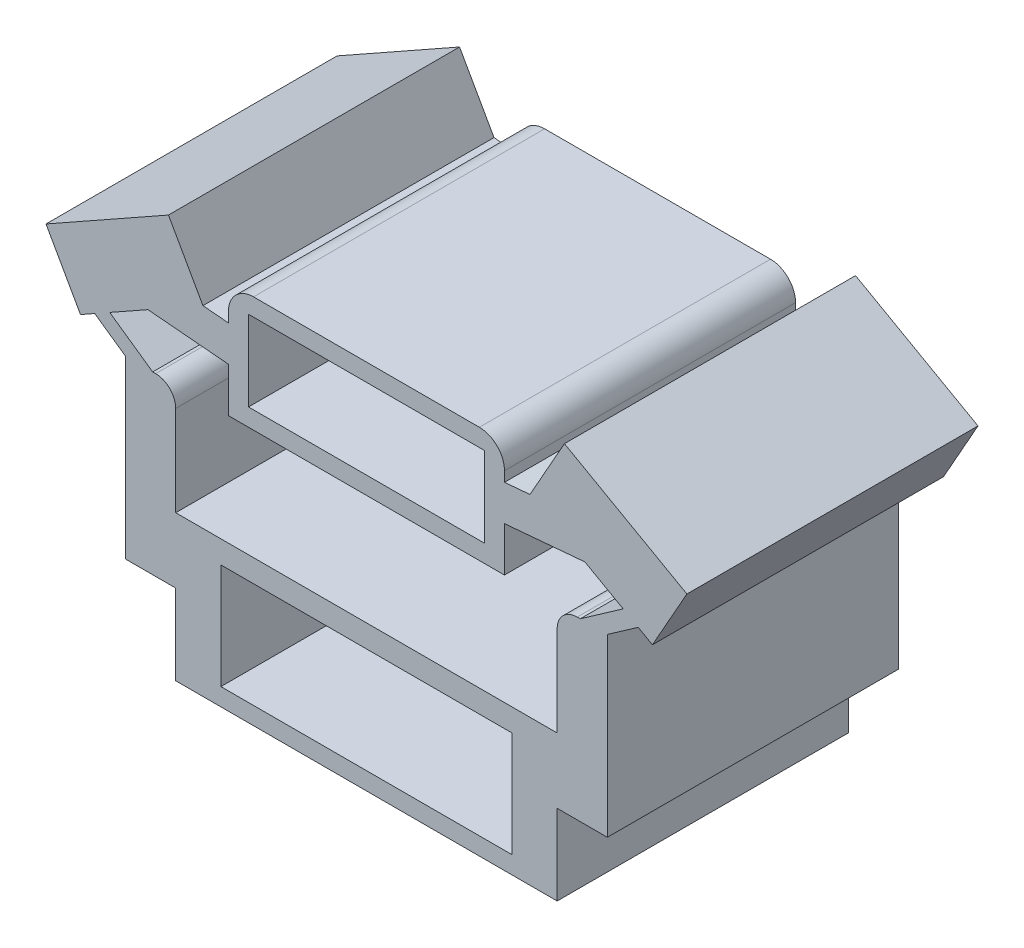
ISO-10303-21;
HEADER;
FILE_DESCRIPTION(('STEP AP214'),'2;1');
FILE_NAME('part.step','',(''),(''),'','','');
FILE_SCHEMA(('AUTOMOTIVE_DESIGN { 1 0 10303 214 1 1 1 1 }'));
ENDSEC;
DATA;
#1=APPLICATION_CONTEXT('core data for automotive mechanical design processes');
#2=APPLICATION_PROTOCOL_DEFINITION('international standard','automotive_design',2000,#1);
#3=PRODUCT_CONTEXT('',#1,'mechanical');
#4=PRODUCT('Part','Part','',(#3));
#5=PRODUCT_RELATED_PRODUCT_CATEGORY('part','',(#4));
#6=PRODUCT_DEFINITION_FORMATION('','',#4);
#7=PRODUCT_DEFINITION_CONTEXT('part definition',#1,'design');
#8=PRODUCT_DEFINITION('design','',#6,#7);
#9=PRODUCT_DEFINITION_SHAPE('','',#8);
#10=(LENGTH_UNIT() NAMED_UNIT(*) SI_UNIT(.MILLI.,.METRE.));
#11=(NAMED_UNIT(*) PLANE_ANGLE_UNIT() SI_UNIT($,.RADIAN.));
#12=(NAMED_UNIT(*) SI_UNIT($,.STERADIAN.) SOLID_ANGLE_UNIT());
#13=UNCERTAINTY_MEASURE_WITH_UNIT(LENGTH_MEASURE(1.E-05),#10,'distance_accuracy_value','');
#14=(GEOMETRIC_REPRESENTATION_CONTEXT(3) GLOBAL_UNCERTAINTY_ASSIGNED_CONTEXT((#13)) GLOBAL_UNIT_ASSIGNED_CONTEXT((#10,
#11,#12)) REPRESENTATION_CONTEXT('',''));
#15=CARTESIAN_POINT('',(0.,0.,0.));
#16=DIRECTION('',(0.,0.,1.));
#17=DIRECTION('',(1.,0.,0.));
#18=AXIS2_PLACEMENT_3D('',#15,#16,#17);
#19=CARTESIAN_POINT('',(3.8,1.4,5.8));
#20=DIRECTION('',(1.,0.,0.));
#21=DIRECTION('',(0.,0.,-1.));
#22=AXIS2_PLACEMENT_3D('',#19,#20,#21);
#23=PLANE('',#22);
#24=DIRECTION('',(0.,-1.,0.));
#25=VECTOR('',#24,1.);
#26=CARTESIAN_POINT('',(3.8,1.4,5.8));
#27=LINE('',#26,#25);
#28=CARTESIAN_POINT('',(3.8,3.2,5.8));
#29=VERTEX_POINT('',#28);
#30=CARTESIAN_POINT('',(3.8,1.4,5.8));
#31=VERTEX_POINT('',#30);
#32=EDGE_CURVE('E546',#29,#31,#27,.T.);
#33=ORIENTED_EDGE('',*,*,#32,.F.);
#34=DIRECTION('',(0.,0.,-1.));
#35=VECTOR('',#34,1.);
#36=CARTESIAN_POINT('',(3.8,3.2,5.8));
#37=LINE('',#36,#35);
#38=CARTESIAN_POINT('',(3.8,3.2,0.));
#39=VERTEX_POINT('',#38);
#40=EDGE_CURVE('E45',#29,#39,#37,.T.);
#41=ORIENTED_EDGE('',*,*,#40,.T.);
#42=DIRECTION('',(0.,-1.,0.));
#43=VECTOR('',#42,1.);
#44=CARTESIAN_POINT('',(3.8,1.4,0.));
#45=LINE('',#44,#43);
#46=CARTESIAN_POINT('',(3.8,1.4,0.));
#47=VERTEX_POINT('',#46);
#48=EDGE_CURVE('E545',#39,#47,#45,.T.);
#49=ORIENTED_EDGE('',*,*,#48,.T.);
#50=DIRECTION('',(0.,0.,-1.));
#51=VECTOR('',#50,1.);
#52=CARTESIAN_POINT('',(3.8,1.4,5.8));
#53=LINE('',#52,#51);
#54=EDGE_CURVE('E674',#31,#47,#53,.T.);
#55=ORIENTED_EDGE('',*,*,#54,.F.);
#56=EDGE_LOOP('',(#33,#41,#49,#55));
#57=FACE_BOUND('',#56,.T.);
#58=ADVANCED_FACE('F37',(#57),#23,.F.);
#59=CARTESIAN_POINT('',(-3.8,1.4,5.8));
#60=DIRECTION('',(0.,-1.,0.));
#61=DIRECTION('',(1.,0.,0.));
#62=AXIS2_PLACEMENT_3D('',#59,#60,#61);
#63=PLANE('',#62);
#64=DIRECTION('',(-1.,0.,0.));
#65=VECTOR('',#64,1.);
#66=CARTESIAN_POINT('',(-3.8,1.4,0.));
#67=LINE('',#66,#65);
#68=CARTESIAN_POINT('',(-3.8,1.4,0.));
#69=VERTEX_POINT('',#68);
#70=EDGE_CURVE('E588',#47,#69,#67,.T.);
#71=ORIENTED_EDGE('',*,*,#70,.T.);
#72=DIRECTION('',(0.,0.,-1.));
#73=VECTOR('',#72,1.);
#74=CARTESIAN_POINT('',(-3.8,1.4,5.8));
#75=LINE('',#74,#73);
#76=CARTESIAN_POINT('',(-3.8,1.4,5.8));
#77=VERTEX_POINT('',#76);
#78=EDGE_CURVE('E671',#77,#69,#75,.T.);
#79=ORIENTED_EDGE('',*,*,#78,.F.);
#80=DIRECTION('',(-1.,0.,0.));
#81=VECTOR('',#80,1.);
#82=CARTESIAN_POINT('',(-3.8,1.4,5.8));
#83=LINE('',#82,#81);
#84=EDGE_CURVE('E548',#31,#77,#83,.T.);
#85=ORIENTED_EDGE('',*,*,#84,.F.);
#86=ORIENTED_EDGE('',*,*,#54,.T.);
#87=EDGE_LOOP('',(#71,#79,#85,#86));
#88=FACE_BOUND('',#87,.T.);
#89=ADVANCED_FACE('F721',(#88),#63,.F.);
#90=CARTESIAN_POINT('',(-3.8,-1.4,5.8));
#91=DIRECTION('',(1.,0.,0.));
#92=DIRECTION('',(0.,0.,-1.));
#93=AXIS2_PLACEMENT_3D('',#90,#91,#92);
#94=PLANE('',#93);
#95=DIRECTION('',(0.,-1.,0.));
#96=VECTOR('',#95,1.);
#97=CARTESIAN_POINT('',(-3.8,-1.4,5.8));
#98=LINE('',#97,#96);
#99=CARTESIAN_POINT('',(-3.8,0.1,5.8));
#100=VERTEX_POINT('',#99);
#101=CARTESIAN_POINT('',(-3.8,-1.5,5.8));
#102=VERTEX_POINT('',#101);
#103=EDGE_CURVE('E552',#100,#102,#98,.T.);
#104=ORIENTED_EDGE('',*,*,#103,.F.);
#105=DIRECTION('',(0.,0.,-1.));
#106=VECTOR('',#105,1.);
#107=CARTESIAN_POINT('',(-3.8,0.1,5.8));
#108=LINE('',#107,#106);
#109=CARTESIAN_POINT('',(-3.8,0.1,0.));
#110=VERTEX_POINT('',#109);
#111=EDGE_CURVE('E483',#100,#110,#108,.T.);
#112=ORIENTED_EDGE('',*,*,#111,.T.);
#113=DIRECTION('',(0.,-1.,0.));
#114=VECTOR('',#113,1.);
#115=CARTESIAN_POINT('',(-3.8,-1.4,0.));
#116=LINE('',#115,#114);
#117=CARTESIAN_POINT('',(-3.8,-1.5,0.));
#118=VERTEX_POINT('',#117);
#119=EDGE_CURVE('E591',#110,#118,#116,.T.);
#120=ORIENTED_EDGE('',*,*,#119,.T.);
#121=DIRECTION('',(0.,0.,1.));
#122=VECTOR('',#121,1.);
#123=CARTESIAN_POINT('',(-3.8,-1.5,-7.60065786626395));
#124=LINE('',#123,#122);
#125=EDGE_CURVE('E383',#118,#102,#124,.T.);
#126=ORIENTED_EDGE('',*,*,#125,.T.);
#127=EDGE_LOOP('',(#104,#112,#120,#126));
#128=FACE_BOUND('',#127,.T.);
#129=ADVANCED_FACE('F784',(#128),#94,.F.);
#130=CARTESIAN_POINT('',(3.8,-1.4,5.8));
#131=DIRECTION('',(-1.,0.,0.));
#132=DIRECTION('',(0.,0.,1.));
#133=AXIS2_PLACEMENT_3D('',#130,#131,#132);
#134=PLANE('',#133);
#135=DIRECTION('',(0.,1.,0.));
#136=VECTOR('',#135,1.);
#137=CARTESIAN_POINT('',(3.8,-1.4,0.));
#138=LINE('',#137,#136);
#139=CARTESIAN_POINT('',(3.8,-1.5,0.));
#140=VERTEX_POINT('',#139);
#141=CARTESIAN_POINT('',(3.8,0.1,0.));
#142=VERTEX_POINT('',#141);
#143=EDGE_CURVE('E593',#140,#142,#138,.T.);
#144=ORIENTED_EDGE('',*,*,#143,.T.);
#145=DIRECTION('',(0.,0.,-1.));
#146=VECTOR('',#145,1.);
#147=CARTESIAN_POINT('',(3.8,0.1,5.8));
#148=LINE('',#147,#146);
#149=CARTESIAN_POINT('',(3.8,0.1,5.8));
#150=VERTEX_POINT('',#149);
#151=EDGE_CURVE('E668',#150,#142,#148,.T.);
#152=ORIENTED_EDGE('',*,*,#151,.F.);
#153=DIRECTION('',(0.,1.,0.));
#154=VECTOR('',#153,1.);
#155=CARTESIAN_POINT('',(3.8,-1.4,5.8));
#156=LINE('',#155,#154);
#157=CARTESIAN_POINT('',(3.8,-1.5,5.8));
#158=VERTEX_POINT('',#157);
#159=EDGE_CURVE('E554',#158,#150,#156,.T.);
#160=ORIENTED_EDGE('',*,*,#159,.F.);
#161=DIRECTION('',(0.,0.,1.));
#162=VECTOR('',#161,1.);
#163=CARTESIAN_POINT('',(3.8,-1.5,-7.60065786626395));
#164=LINE('',#163,#162);
#165=EDGE_CURVE('E380',#140,#158,#164,.T.);
#166=ORIENTED_EDGE('',*,*,#165,.F.);
#167=EDGE_LOOP('',(#144,#152,#160,#166));
#168=FACE_BOUND('',#167,.T.);
#169=ADVANCED_FACE('F857',(#168),#134,.F.);
#170=CARTESIAN_POINT('',(3.8,0.1,5.8));
#171=DIRECTION('',(0.,1.,0.));
#172=DIRECTION('',(0.,0.,1.));
#173=AXIS2_PLACEMENT_3D('',#170,#171,#172);
#174=PLANE('',#173);
#175=DIRECTION('',(1.,0.,0.));
#176=VECTOR('',#175,1.);
#177=CARTESIAN_POINT('',(3.8,0.1,0.));
#178=LINE('',#177,#176);
#179=CARTESIAN_POINT('',(4.8,0.1,0.));
#180=VERTEX_POINT('',#179);
#181=EDGE_CURVE('E595',#142,#180,#178,.T.);
#182=ORIENTED_EDGE('',*,*,#181,.T.);
#183=DIRECTION('',(0.,0.,-1.));
#184=VECTOR('',#183,1.);
#185=CARTESIAN_POINT('',(4.8,0.1,5.8));
#186=LINE('',#185,#184);
#187=CARTESIAN_POINT('',(4.8,0.1,5.8));
#188=VERTEX_POINT('',#187);
#189=EDGE_CURVE('E665',#188,#180,#186,.T.);
#190=ORIENTED_EDGE('',*,*,#189,.F.);
#191=DIRECTION('',(1.,0.,0.));
#192=VECTOR('',#191,1.);
#193=CARTESIAN_POINT('',(3.8,0.1,5.8));
#194=LINE('',#193,#192);
#195=EDGE_CURVE('E556',#150,#188,#194,.T.);
#196=ORIENTED_EDGE('',*,*,#195,.F.);
#197=ORIENTED_EDGE('',*,*,#151,.T.);
#198=EDGE_LOOP('',(#182,#190,#196,#197));
#199=FACE_BOUND('',#198,.T.);
#200=ADVANCED_FACE('F853',(#199),#174,.F.);
#201=CARTESIAN_POINT('',(4.8,3.6,5.8));
#202=DIRECTION('',(-1.,0.,0.));
#203=DIRECTION('',(0.,-1.,0.));
#204=AXIS2_PLACEMENT_3D('',#201,#202,#203);
#205=PLANE('',#204);
#206=DIRECTION('',(0.,1.,0.));
#207=VECTOR('',#206,1.);
#208=CARTESIAN_POINT('',(4.8,3.6,0.));
#209=LINE('',#208,#207);
#210=CARTESIAN_POINT('',(4.8,3.6,0.));
#211=VERTEX_POINT('',#210);
#212=EDGE_CURVE('E597',#180,#211,#209,.T.);
#213=ORIENTED_EDGE('',*,*,#212,.T.);
#214=DIRECTION('',(0.,0.,-1.));
#215=VECTOR('',#214,1.);
#216=CARTESIAN_POINT('',(4.8,3.6,5.8));
#217=LINE('',#216,#215);
#218=CARTESIAN_POINT('',(4.8,3.6,5.8));
#219=VERTEX_POINT('',#218);
#220=EDGE_CURVE('E662',#219,#211,#217,.T.);
#221=ORIENTED_EDGE('',*,*,#220,.F.);
#222=DIRECTION('',(0.,1.,0.));
#223=VECTOR('',#222,1.);
#224=CARTESIAN_POINT('',(4.8,3.6,5.8));
#225=LINE('',#224,#223);
#226=EDGE_CURVE('E558',#188,#219,#225,.T.);
#227=ORIENTED_EDGE('',*,*,#226,.F.);
#228=ORIENTED_EDGE('',*,*,#189,.T.);
#229=EDGE_LOOP('',(#213,#221,#227,#228));
#230=FACE_BOUND('',#229,.T.);
#231=ADVANCED_FACE('F847',(#230),#205,.F.);
#232=CARTESIAN_POINT('',(4.8,3.6,5.8));
#233=DIRECTION('',(-0.573576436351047,0.819152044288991,0.));
#234=DIRECTION('',(-0.819152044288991,-0.573576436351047,0.));
#235=AXIS2_PLACEMENT_3D('',#232,#233,#234);
#236=PLANE('',#235);
#237=DIRECTION('',(0.819152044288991,0.573576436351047,0.));
#238=VECTOR('',#237,1.);
#239=CARTESIAN_POINT('',(4.8,3.6,0.));
#240=LINE('',#239,#238);
#241=CARTESIAN_POINT('',(5.41436403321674,4.03018232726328,0.));
#242=VERTEX_POINT('',#241);
#243=EDGE_CURVE('E599',#211,#242,#240,.T.);
#244=ORIENTED_EDGE('',*,*,#243,.T.);
#245=DIRECTION('',(0.,0.,-1.));
#246=VECTOR('',#245,1.);
#247=CARTESIAN_POINT('',(5.41436403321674,4.03018232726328,5.8));
#248=LINE('',#247,#246);
#249=CARTESIAN_POINT('',(5.41436403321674,4.03018232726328,5.8));
#250=VERTEX_POINT('',#249);
#251=EDGE_CURVE('E659',#250,#242,#248,.T.);
#252=ORIENTED_EDGE('',*,*,#251,.F.);
#253=DIRECTION('',(0.819152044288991,0.573576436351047,0.));
#254=VECTOR('',#253,1.);
#255=CARTESIAN_POINT('',(4.8,3.6,5.8));
#256=LINE('',#255,#254);
#257=EDGE_CURVE('E560',#219,#250,#256,.T.);
#258=ORIENTED_EDGE('',*,*,#257,.F.);
#259=ORIENTED_EDGE('',*,*,#220,.T.);
#260=EDGE_LOOP('',(#244,#252,#258,#259));
#261=FACE_BOUND('',#260,.T.);
#262=ADVANCED_FACE('F843',(#261),#236,.F.);
#263=CARTESIAN_POINT('',(5.41436403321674,4.03018232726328,5.8));
#264=DIRECTION('',(0.490674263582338,0.87134308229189,0.));
#265=DIRECTION('',(-0.87134308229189,0.490674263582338,0.));
#266=AXIS2_PLACEMENT_3D('',#263,#264,#265);
#267=PLANE('',#266);
#268=DIRECTION('',(0.87134308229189,-0.490674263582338,0.));
#269=VECTOR('',#268,1.);
#270=CARTESIAN_POINT('',(5.41436403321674,4.03018232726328,0.));
#271=LINE('',#270,#269);
#272=CARTESIAN_POINT('',(5.69781992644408,3.87056149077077,0.));
#273=VERTEX_POINT('',#272);
#274=EDGE_CURVE('E601',#242,#273,#271,.T.);
#275=ORIENTED_EDGE('',*,*,#274,.T.);
#276=DIRECTION('',(0.,0.,-1.));
#277=VECTOR('',#276,1.);
#278=CARTESIAN_POINT('',(5.69781992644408,3.87056149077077,5.8));
#279=LINE('',#278,#277);
#280=CARTESIAN_POINT('',(5.69781992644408,3.87056149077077,5.8));
#281=VERTEX_POINT('',#280);
#282=EDGE_CURVE('E656',#281,#273,#279,.T.);
#283=ORIENTED_EDGE('',*,*,#282,.F.);
#284=DIRECTION('',(0.87134308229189,-0.490674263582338,0.));
#285=VECTOR('',#284,1.);
#286=CARTESIAN_POINT('',(5.41436403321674,4.03018232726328,5.8));
#287=LINE('',#286,#285);
#288=EDGE_CURVE('E562',#250,#281,#287,.T.);
#289=ORIENTED_EDGE('',*,*,#288,.F.);
#290=ORIENTED_EDGE('',*,*,#251,.T.);
#291=EDGE_LOOP('',(#275,#283,#289,#290));
#292=FACE_BOUND('',#291,.T.);
#293=ADVANCED_FACE('F838',(#292),#267,.F.);
#294=CARTESIAN_POINT('',(5.69781992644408,3.87056149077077,5.8));
#295=DIRECTION('',(-0.871343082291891,0.490674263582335,0.));
#296=DIRECTION('',(-0.490674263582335,-0.871343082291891,0.));
#297=AXIS2_PLACEMENT_3D('',#294,#295,#296);
#298=PLANE('',#297);
#299=DIRECTION('',(0.490674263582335,0.871343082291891,0.));
#300=VECTOR('',#299,1.);
#301=CARTESIAN_POINT('',(5.69781992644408,3.87056149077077,0.));
#302=LINE('',#301,#300);
#303=CARTESIAN_POINT('',(6.38476389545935,5.09044180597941,0.));
#304=VERTEX_POINT('',#303);
#305=EDGE_CURVE('E603',#273,#304,#302,.T.);
#306=ORIENTED_EDGE('',*,*,#305,.T.);
#307=DIRECTION('',(0.,0.,-1.));
#308=VECTOR('',#307,1.);
#309=CARTESIAN_POINT('',(6.38476389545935,5.09044180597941,5.8));
#310=LINE('',#309,#308);
#311=CARTESIAN_POINT('',(6.38476389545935,5.09044180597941,5.8));
#312=VERTEX_POINT('',#311);
#313=EDGE_CURVE('E653',#312,#304,#310,.T.);
#314=ORIENTED_EDGE('',*,*,#313,.F.);
#315=DIRECTION('',(0.490674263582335,0.871343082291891,0.));
#316=VECTOR('',#315,1.);
#317=CARTESIAN_POINT('',(5.69781992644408,3.87056149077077,5.8));
#318=LINE('',#317,#316);
#319=EDGE_CURVE('E564',#281,#312,#318,.T.);
#320=ORIENTED_EDGE('',*,*,#319,.F.);
#321=ORIENTED_EDGE('',*,*,#282,.T.);
#322=EDGE_LOOP('',(#306,#314,#320,#321));
#323=FACE_BOUND('',#322,.T.);
#324=ADVANCED_FACE('F832',(#323),#298,.F.);
#325=CARTESIAN_POINT('',(3.94500326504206,6.46432974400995,5.8));
#326=DIRECTION('',(-0.490674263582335,-0.871343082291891,0.));
#327=DIRECTION('',(0.871343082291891,-0.490674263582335,0.));
#328=AXIS2_PLACEMENT_3D('',#325,#326,#327);
#329=PLANE('',#328);
#330=DIRECTION('',(-0.871343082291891,0.490674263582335,0.));
#331=VECTOR('',#330,1.);
#332=CARTESIAN_POINT('',(3.94500326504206,6.46432974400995,0.));
#333=LINE('',#332,#331);
#334=CARTESIAN_POINT('',(3.94500326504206,6.46432974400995,0.));
#335=VERTEX_POINT('',#334);
#336=EDGE_CURVE('E605',#304,#335,#333,.T.);
#337=ORIENTED_EDGE('',*,*,#336,.T.);
#338=DIRECTION('',(0.,0.,-1.));
#339=VECTOR('',#338,1.);
#340=CARTESIAN_POINT('',(3.94500326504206,6.46432974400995,5.8));
#341=LINE('',#340,#339);
#342=CARTESIAN_POINT('',(3.94500326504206,6.46432974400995,5.8));
#343=VERTEX_POINT('',#342);
#344=EDGE_CURVE('E650',#343,#335,#341,.T.);
#345=ORIENTED_EDGE('',*,*,#344,.F.);
#346=DIRECTION('',(-0.871343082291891,0.490674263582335,0.));
#347=VECTOR('',#346,1.);
#348=CARTESIAN_POINT('',(3.94500326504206,6.46432974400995,5.8));
#349=LINE('',#348,#347);
#350=EDGE_CURVE('E566',#312,#343,#349,.T.);
#351=ORIENTED_EDGE('',*,*,#350,.F.);
#352=ORIENTED_EDGE('',*,*,#313,.T.);
#353=EDGE_LOOP('',(#337,#345,#351,#352));
#354=FACE_BOUND('',#353,.T.);
#355=ADVANCED_FACE('F828',(#354),#329,.F.);
#356=CARTESIAN_POINT('',(3.94500326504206,6.46432974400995,5.8));
#357=DIRECTION('',(0.871343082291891,-0.490674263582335,0.));
#358=DIRECTION('',(0.490674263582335,0.871343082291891,0.));
#359=AXIS2_PLACEMENT_3D('',#356,#357,#358);
#360=PLANE('',#359);
#361=DIRECTION('',(-0.490674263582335,-0.871343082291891,0.));
#362=VECTOR('',#361,1.);
#363=CARTESIAN_POINT('',(3.94500326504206,6.46432974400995,0.));
#364=LINE('',#363,#362);
#365=CARTESIAN_POINT('',(3.25805929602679,5.24444942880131,0.));
#366=VERTEX_POINT('',#365);
#367=EDGE_CURVE('E607',#335,#366,#364,.T.);
#368=ORIENTED_EDGE('',*,*,#367,.T.);
#369=DIRECTION('',(0.,0.,-1.));
#370=VECTOR('',#369,1.);
#371=CARTESIAN_POINT('',(3.25805929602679,5.24444942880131,5.8));
#372=LINE('',#371,#370);
#373=CARTESIAN_POINT('',(3.25805929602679,5.24444942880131,5.8));
#374=VERTEX_POINT('',#373);
#375=EDGE_CURVE('E647',#374,#366,#372,.T.);
#376=ORIENTED_EDGE('',*,*,#375,.F.);
#377=DIRECTION('',(-0.490674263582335,-0.871343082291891,0.));
#378=VECTOR('',#377,1.);
#379=CARTESIAN_POINT('',(3.94500326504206,6.46432974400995,5.8));
#380=LINE('',#379,#378);
#381=EDGE_CURVE('E568',#343,#374,#380,.T.);
#382=ORIENTED_EDGE('',*,*,#381,.F.);
#383=ORIENTED_EDGE('',*,*,#344,.T.);
#384=EDGE_LOOP('',(#368,#376,#382,#383));
#385=FACE_BOUND('',#384,.T.);
#386=ADVANCED_FACE('F823',(#385),#360,.F.);
#387=CARTESIAN_POINT('',(2.75,5.2,5.8));
#388=DIRECTION('',(0.0871557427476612,-0.996194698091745,0.));
#389=DIRECTION('',(0.996194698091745,0.0871557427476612,0.));
#390=AXIS2_PLACEMENT_3D('',#387,#388,#389);
#391=PLANE('',#390);
#392=DIRECTION('',(-0.996194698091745,-0.0871557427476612,0.));
#393=VECTOR('',#392,1.);
#394=CARTESIAN_POINT('',(2.75,5.2,0.));
#395=LINE('',#394,#393);
#396=CARTESIAN_POINT('',(2.75,5.2,0.));
#397=VERTEX_POINT('',#396);
#398=EDGE_CURVE('E609',#366,#397,#395,.T.);
#399=ORIENTED_EDGE('',*,*,#398,.T.);
#400=DIRECTION('',(0.,0.,-1.));
#401=VECTOR('',#400,1.);
#402=CARTESIAN_POINT('',(2.75,5.2,5.8));
#403=LINE('',#402,#401);
#404=CARTESIAN_POINT('',(2.75,5.2,5.8));
#405=VERTEX_POINT('',#404);
#406=EDGE_CURVE('E644',#405,#397,#403,.T.);
#407=ORIENTED_EDGE('',*,*,#406,.F.);
#408=DIRECTION('',(-0.996194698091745,-0.0871557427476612,0.));
#409=VECTOR('',#408,1.);
#410=CARTESIAN_POINT('',(2.75,5.2,5.8));
#411=LINE('',#410,#409);
#412=EDGE_CURVE('E570',#374,#405,#411,.T.);
#413=ORIENTED_EDGE('',*,*,#412,.F.);
#414=ORIENTED_EDGE('',*,*,#375,.T.);
#415=EDGE_LOOP('',(#399,#407,#413,#414));
#416=FACE_BOUND('',#415,.T.);
#417=ADVANCED_FACE('F817',(#416),#391,.F.);
#418=CARTESIAN_POINT('',(-2.75,5.2,5.8));
#419=DIRECTION('',(1.,0.,0.));
#420=DIRECTION('',(0.,0.,-1.));
#421=AXIS2_PLACEMENT_3D('',#418,#419,#420);
#422=PLANE('',#421);
#423=DIRECTION('',(0.,-1.,0.));
#424=VECTOR('',#423,1.);
#425=CARTESIAN_POINT('',(-2.75,5.2,5.8));
#426=LINE('',#425,#424);
#427=CARTESIAN_POINT('',(-2.75,4.48728791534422,5.8));
#428=VERTEX_POINT('',#427);
#429=CARTESIAN_POINT('',(-2.75,3.6,5.8));
#430=VERTEX_POINT('',#429);
#431=EDGE_CURVE('E572',#428,#430,#426,.T.);
#432=ORIENTED_EDGE('',*,*,#431,.F.);
#433=DIRECTION('',(0.,0.,-1.));
#434=VECTOR('',#433,1.);
#435=CARTESIAN_POINT('',(-2.75,4.48728791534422,5.8));
#436=LINE('',#435,#434);
#437=CARTESIAN_POINT('',(-2.75,4.48728791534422,0.));
#438=VERTEX_POINT('',#437);
#439=EDGE_CURVE('E536',#428,#438,#436,.T.);
#440=ORIENTED_EDGE('',*,*,#439,.T.);
#441=DIRECTION('',(0.,-1.,0.));
#442=VECTOR('',#441,1.);
#443=CARTESIAN_POINT('',(-2.75,5.2,0.));
#444=LINE('',#443,#442);
#445=CARTESIAN_POINT('',(-2.75,3.6,0.));
#446=VERTEX_POINT('',#445);
#447=EDGE_CURVE('E611',#438,#446,#444,.T.);
#448=ORIENTED_EDGE('',*,*,#447,.T.);
#449=DIRECTION('',(0.,0.,-1.));
#450=VECTOR('',#449,1.);
#451=CARTESIAN_POINT('',(-2.75,3.6,5.8));
#452=LINE('',#451,#450);
#453=EDGE_CURVE('E638',#430,#446,#452,.T.);
#454=ORIENTED_EDGE('',*,*,#453,.F.);
#455=EDGE_LOOP('',(#432,#440,#448,#454));
#456=FACE_BOUND('',#455,.T.);
#457=ADVANCED_FACE('F751',(#456),#422,.F.);
#458=CARTESIAN_POINT('',(-2.75,3.6,5.8));
#459=DIRECTION('',(0.,1.,0.));
#460=DIRECTION('',(0.,0.,1.));
#461=AXIS2_PLACEMENT_3D('',#458,#459,#460);
#462=PLANE('',#461);
#463=DIRECTION('',(1.,0.,0.));
#464=VECTOR('',#463,1.);
#465=CARTESIAN_POINT('',(-2.75,3.6,0.));
#466=LINE('',#465,#464);
#467=CARTESIAN_POINT('',(2.75,3.6,0.));
#468=VERTEX_POINT('',#467);
#469=EDGE_CURVE('E613',#446,#468,#466,.T.);
#470=ORIENTED_EDGE('',*,*,#469,.T.);
#471=DIRECTION('',(0.,0.,-1.));
#472=VECTOR('',#471,1.);
#473=CARTESIAN_POINT('',(2.75,3.6,5.8));
#474=LINE('',#473,#472);
#475=CARTESIAN_POINT('',(2.75,3.6,5.8));
#476=VERTEX_POINT('',#475);
#477=EDGE_CURVE('E635',#476,#468,#474,.T.);
#478=ORIENTED_EDGE('',*,*,#477,.F.);
#479=DIRECTION('',(1.,0.,0.));
#480=VECTOR('',#479,1.);
#481=CARTESIAN_POINT('',(-2.75,3.6,5.8));
#482=LINE('',#481,#480);
#483=EDGE_CURVE('E574',#430,#476,#482,.T.);
#484=ORIENTED_EDGE('',*,*,#483,.F.);
#485=ORIENTED_EDGE('',*,*,#453,.T.);
#486=EDGE_LOOP('',(#470,#478,#484,#485));
#487=FACE_BOUND('',#486,.T.);
#488=ADVANCED_FACE('F754',(#487),#462,.F.);
#489=CARTESIAN_POINT('',(2.75,4.48728791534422,5.8));
#490=DIRECTION('',(-1.,0.,0.));
#491=DIRECTION('',(0.,0.,1.));
#492=AXIS2_PLACEMENT_3D('',#489,#490,#491);
#493=PLANE('',#492);
#494=DIRECTION('',(0.,1.,0.));
#495=VECTOR('',#494,1.);
#496=CARTESIAN_POINT('',(2.75,4.48728791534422,0.));
#497=LINE('',#496,#495);
#498=CARTESIAN_POINT('',(2.75,4.48728791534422,0.));
#499=VERTEX_POINT('',#498);
#500=EDGE_CURVE('E615',#468,#499,#497,.T.);
#501=ORIENTED_EDGE('',*,*,#500,.T.);
#502=DIRECTION('',(0.,0.,-1.));
#503=VECTOR('',#502,1.);
#504=CARTESIAN_POINT('',(2.75,4.48728791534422,5.8));
#505=LINE('',#504,#503);
#506=CARTESIAN_POINT('',(2.75,4.48728791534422,5.8));
#507=VERTEX_POINT('',#506);
#508=EDGE_CURVE('E632',#507,#499,#505,.T.);
#509=ORIENTED_EDGE('',*,*,#508,.F.);
#510=DIRECTION('',(0.,1.,0.));
#511=VECTOR('',#510,1.);
#512=CARTESIAN_POINT('',(2.75,4.48728791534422,5.8));
#513=LINE('',#512,#511);
#514=EDGE_CURVE('E576',#476,#507,#513,.T.);
#515=ORIENTED_EDGE('',*,*,#514,.F.);
#516=ORIENTED_EDGE('',*,*,#477,.T.);
#517=EDGE_LOOP('',(#501,#509,#515,#516));
#518=FACE_BOUND('',#517,.T.);
#519=ADVANCED_FACE('F759',(#518),#493,.F.);
#520=CARTESIAN_POINT('',(2.75,4.48728791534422,5.8));
#521=DIRECTION('',(-0.0871557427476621,0.996194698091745,0.));
#522=DIRECTION('',(-0.996194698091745,-0.0871557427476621,0.));
#523=AXIS2_PLACEMENT_3D('',#520,#521,#522);
#524=PLANE('',#523);
#525=DIRECTION('',(0.996194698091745,0.0871557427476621,0.));
#526=VECTOR('',#525,1.);
#527=CARTESIAN_POINT('',(2.75,4.48728791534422,0.));
#528=LINE('',#527,#526);
#529=CARTESIAN_POINT('',(4.35350678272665,4.62757658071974,0.));
#530=VERTEX_POINT('',#529);
#531=EDGE_CURVE('E617',#499,#530,#528,.T.);
#532=ORIENTED_EDGE('',*,*,#531,.T.);
#533=DIRECTION('',(0.,0.,-1.));
#534=VECTOR('',#533,1.);
#535=CARTESIAN_POINT('',(4.35350678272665,4.62757658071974,5.8));
#536=LINE('',#535,#534);
#537=CARTESIAN_POINT('',(4.35350678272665,4.62757658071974,5.8));
#538=VERTEX_POINT('',#537);
#539=EDGE_CURVE('E629',#538,#530,#536,.T.);
#540=ORIENTED_EDGE('',*,*,#539,.F.);
#541=DIRECTION('',(0.996194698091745,0.0871557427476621,0.));
#542=VECTOR('',#541,1.);
#543=CARTESIAN_POINT('',(2.75,4.48728791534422,5.8));
#544=LINE('',#543,#542);
#545=EDGE_CURVE('E578',#507,#538,#544,.T.);
#546=ORIENTED_EDGE('',*,*,#545,.F.);
#547=ORIENTED_EDGE('',*,*,#508,.T.);
#548=EDGE_LOOP('',(#532,#540,#546,#547));
#549=FACE_BOUND('',#548,.T.);
#550=ADVANCED_FACE('F765',(#549),#524,.F.);
#551=CARTESIAN_POINT('',(4.35350678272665,4.62757658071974,5.8));
#552=DIRECTION('',(0.490674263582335,0.871343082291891,0.));
#553=DIRECTION('',(-0.871343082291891,0.490674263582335,0.));
#554=AXIS2_PLACEMENT_3D('',#551,#552,#553);
#555=PLANE('',#554);
#556=DIRECTION('',(0.871343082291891,-0.490674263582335,0.));
#557=VECTOR('',#556,1.);
#558=CARTESIAN_POINT('',(4.35350678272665,4.62757658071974,0.));
#559=LINE('',#558,#557);
#560=CARTESIAN_POINT('',(5.11480679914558,4.19887021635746,0.));
#561=VERTEX_POINT('',#560);
#562=EDGE_CURVE('E619',#530,#561,#559,.T.);
#563=ORIENTED_EDGE('',*,*,#562,.T.);
#564=DIRECTION('',(0.,0.,-1.));
#565=VECTOR('',#564,1.);
#566=CARTESIAN_POINT('',(5.11480679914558,4.19887021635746,5.8));
#567=LINE('',#566,#565);
#568=CARTESIAN_POINT('',(5.11480679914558,4.19887021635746,5.8));
#569=VERTEX_POINT('',#568);
#570=EDGE_CURVE('E626',#569,#561,#567,.T.);
#571=ORIENTED_EDGE('',*,*,#570,.F.);
#572=DIRECTION('',(0.871343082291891,-0.490674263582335,0.));
#573=VECTOR('',#572,1.);
#574=CARTESIAN_POINT('',(4.35350678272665,4.62757658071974,5.8));
#575=LINE('',#574,#573);
#576=EDGE_CURVE('E580',#538,#569,#575,.T.);
#577=ORIENTED_EDGE('',*,*,#576,.F.);
#578=ORIENTED_EDGE('',*,*,#539,.T.);
#579=EDGE_LOOP('',(#563,#571,#577,#578));
#580=FACE_BOUND('',#579,.T.);
#581=ADVANCED_FACE('F769',(#580),#555,.F.);
#582=CARTESIAN_POINT('',(4.25953149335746,3.6,5.8));
#583=DIRECTION('',(0.573576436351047,-0.819152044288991,0.));
#584=DIRECTION('',(0.819152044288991,0.573576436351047,0.));
#585=AXIS2_PLACEMENT_3D('',#582,#583,#584);
#586=PLANE('',#585);
#587=DIRECTION('',(-0.819152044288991,-0.573576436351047,0.));
#588=VECTOR('',#587,1.);
#589=CARTESIAN_POINT('',(4.25953149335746,3.6,0.));
#590=LINE('',#589,#588);
#591=CARTESIAN_POINT('',(4.25953149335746,3.6,0.));
#592=VERTEX_POINT('',#591);
#593=EDGE_CURVE('E621',#561,#592,#590,.T.);
#594=ORIENTED_EDGE('',*,*,#593,.T.);
#595=DIRECTION('',(0.,0.,-1.));
#596=VECTOR('',#595,1.);
#597=CARTESIAN_POINT('',(4.25953149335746,3.6,5.8));
#598=LINE('',#597,#596);
#599=CARTESIAN_POINT('',(4.25953149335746,3.6,5.8));
#600=VERTEX_POINT('',#599);
#601=EDGE_CURVE('E586',#600,#592,#598,.T.);
#602=ORIENTED_EDGE('',*,*,#601,.F.);
#603=DIRECTION('',(-0.819152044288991,-0.573576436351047,0.));
#604=VECTOR('',#603,1.);
#605=CARTESIAN_POINT('',(4.25953149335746,3.6,5.8));
#606=LINE('',#605,#604);
#607=EDGE_CURVE('E582',#569,#600,#606,.T.);
#608=ORIENTED_EDGE('',*,*,#607,.F.);
#609=ORIENTED_EDGE('',*,*,#570,.T.);
#610=EDGE_LOOP('',(#594,#602,#608,#609));
#611=FACE_BOUND('',#610,.T.);
#612=ADVANCED_FACE('F774',(#611),#586,.F.);
#613=CARTESIAN_POINT('',(3.8,3.6,5.8));
#614=DIRECTION('',(0.,-1.,0.));
#615=DIRECTION('',(0.,0.,-1.));
#616=AXIS2_PLACEMENT_3D('',#613,#614,#615);
#617=PLANE('',#616);
#618=DIRECTION('',(-1.,0.,0.));
#619=VECTOR('',#618,1.);
#620=CARTESIAN_POINT('',(3.8,3.6,0.));
#621=LINE('',#620,#619);
#622=CARTESIAN_POINT('',(4.2,3.6,0.));
#623=VERTEX_POINT('',#622);
#624=EDGE_CURVE('E549',#592,#623,#621,.T.);
#625=ORIENTED_EDGE('',*,*,#624,.T.);
#626=DIRECTION('',(0.,0.,-1.));
#627=VECTOR('',#626,1.);
#628=CARTESIAN_POINT('',(4.2,3.6,5.8));
#629=LINE('',#628,#627);
#630=CARTESIAN_POINT('',(4.2,3.6,5.8));
#631=VERTEX_POINT('',#630);
#632=EDGE_CURVE('E11',#623,#631,#629,.F.);
#633=ORIENTED_EDGE('',*,*,#632,.T.);
#634=DIRECTION('',(-1.,0.,0.));
#635=VECTOR('',#634,1.);
#636=CARTESIAN_POINT('',(3.8,3.6,5.8));
#637=LINE('',#636,#635);
#638=EDGE_CURVE('E584',#600,#631,#637,.T.);
#639=ORIENTED_EDGE('',*,*,#638,.F.);
#640=ORIENTED_EDGE('',*,*,#601,.T.);
#641=EDGE_LOOP('',(#625,#633,#639,#640));
#642=FACE_BOUND('',#641,.T.);
#643=ADVANCED_FACE('F966',(#642),#617,.F.);
#644=CARTESIAN_POINT('',(0.,0.,5.8));
#645=DIRECTION('',(0.,0.,-1.));
#646=DIRECTION('',(-1.,0.,0.));
#647=AXIS2_PLACEMENT_3D('',#644,#645,#646);
#648=PLANE('',#647);
#649=DIRECTION('',(1.,0.,0.));
#650=VECTOR('',#649,1.);
#651=CARTESIAN_POINT('',(-2.9,-1.15,5.8));
#652=LINE('',#651,#650);
#653=CARTESIAN_POINT('',(-2.9,-1.15,5.8));
#654=VERTEX_POINT('',#653);
#655=CARTESIAN_POINT('',(2.9,-1.15,5.8));
#656=VERTEX_POINT('',#655);
#657=EDGE_CURVE('E369',#654,#656,#652,.T.);
#658=ORIENTED_EDGE('',*,*,#657,.F.);
#659=DIRECTION('',(0.,-1.,0.));
#660=VECTOR('',#659,1.);
#661=CARTESIAN_POINT('',(-2.9,-1.05,5.8));
#662=LINE('',#661,#660);
#663=CARTESIAN_POINT('',(-2.9,0.95,5.8));
#664=VERTEX_POINT('',#663);
#665=EDGE_CURVE('E360',#664,#654,#662,.T.);
#666=ORIENTED_EDGE('',*,*,#665,.F.);
#667=DIRECTION('',(1.,0.,0.));
#668=VECTOR('',#667,1.);
#669=CARTESIAN_POINT('',(-2.9,0.95,5.8));
#670=LINE('',#669,#668);
#671=CARTESIAN_POINT('',(2.9,0.95,5.8));
#672=VERTEX_POINT('',#671);
#673=EDGE_CURVE('E386',#664,#672,#670,.T.);
#674=ORIENTED_EDGE('',*,*,#673,.T.);
#675=DIRECTION('',(0.,1.,0.));
#676=VECTOR('',#675,1.);
#677=CARTESIAN_POINT('',(2.9,-1.05,5.8));
#678=LINE('',#677,#676);
#679=EDGE_CURVE('E425',#656,#672,#678,.T.);
#680=ORIENTED_EDGE('',*,*,#679,.F.);
#681=EDGE_LOOP('',(#658,#666,#674,#680));
#682=FACE_BOUND('',#681,.T.);
#683=DIRECTION('',(1.,0.,0.));
#684=VECTOR('',#683,1.);
#685=CARTESIAN_POINT('',(2.35,5.55,5.8));
#686=LINE('',#685,#684);
#687=CARTESIAN_POINT('',(-2.35,5.55,5.8));
#688=VERTEX_POINT('',#687);
#689=CARTESIAN_POINT('',(2.35,5.55,5.8));
#690=VERTEX_POINT('',#689);
#691=EDGE_CURVE('E395',#688,#690,#686,.T.);
#692=ORIENTED_EDGE('',*,*,#691,.T.);
#693=DIRECTION('',(0.,1.,0.));
#694=VECTOR('',#693,1.);
#695=CARTESIAN_POINT('',(2.35,5.55,5.8));
#696=LINE('',#695,#694);
#697=CARTESIAN_POINT('',(2.35,3.95,5.8));
#698=VERTEX_POINT('',#697);
#699=EDGE_CURVE('E433',#698,#690,#696,.T.);
#700=ORIENTED_EDGE('',*,*,#699,.F.);
#701=DIRECTION('',(1.,0.,0.));
#702=VECTOR('',#701,1.);
#703=CARTESIAN_POINT('',(-2.35,3.95,5.8));
#704=LINE('',#703,#702);
#705=CARTESIAN_POINT('',(-2.35,3.95,5.8));
#706=VERTEX_POINT('',#705);
#707=EDGE_CURVE('E437',#706,#698,#704,.T.);
#708=ORIENTED_EDGE('',*,*,#707,.F.);
#709=DIRECTION('',(0.,-1.,0.));
#710=VECTOR('',#709,1.);
#711=CARTESIAN_POINT('',(-2.35,5.55000000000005,5.8));
#712=LINE('',#711,#710);
#713=EDGE_CURVE('E423',#688,#706,#712,.T.);
#714=ORIENTED_EDGE('',*,*,#713,.F.);
#715=EDGE_LOOP('',(#692,#700,#708,#714));
#716=FACE_BOUND('',#715,.T.);
#717=DIRECTION('',(-1.,0.,0.));
#718=VECTOR('',#717,1.);
#719=CARTESIAN_POINT('',(-2.75,5.9,5.8));
#720=LINE('',#719,#718);
#721=CARTESIAN_POINT('',(2.25,5.9,5.8));
#722=VERTEX_POINT('',#721);
#723=CARTESIAN_POINT('',(-2.25,5.9,5.8));
#724=VERTEX_POINT('',#723);
#725=EDGE_CURVE('E399',#722,#724,#720,.T.);
#726=ORIENTED_EDGE('',*,*,#725,.T.);
#727=CARTESIAN_POINT('',(-2.25,5.4,5.8));
#728=DIRECTION('',(0.,0.,-1.));
#729=DIRECTION('',(-1.,0.,0.));
#730=AXIS2_PLACEMENT_3D('',#727,#728,#729);
#731=CIRCLE('',#730,0.5);
#732=CARTESIAN_POINT('',(-2.75,5.4,5.8));
#733=VERTEX_POINT('',#732);
#734=EDGE_CURVE('E686',#724,#733,#731,.F.);
#735=ORIENTED_EDGE('',*,*,#734,.T.);
#736=DIRECTION('',(0.,-1.,0.));
#737=VECTOR('',#736,1.);
#738=CARTESIAN_POINT('',(-2.75,5.2,5.8));
#739=LINE('',#738,#737);
#740=CARTESIAN_POINT('',(-2.75,5.2,5.8));
#741=VERTEX_POINT('',#740);
#742=EDGE_CURVE('E396',#733,#741,#739,.T.);
#743=ORIENTED_EDGE('',*,*,#742,.T.);
#744=DIRECTION('',(0.996194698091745,-0.0871557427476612,0.));
#745=VECTOR('',#744,1.);
#746=CARTESIAN_POINT('',(-2.75,5.2,5.8));
#747=LINE('',#746,#745);
#748=CARTESIAN_POINT('',(-3.25805929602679,5.24444942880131,5.8));
#749=VERTEX_POINT('',#748);
#750=EDGE_CURVE('E459',#749,#741,#747,.T.);
#751=ORIENTED_EDGE('',*,*,#750,.F.);
#752=DIRECTION('',(0.490674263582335,-0.871343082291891,0.));
#753=VECTOR('',#752,1.);
#754=CARTESIAN_POINT('',(-3.94500326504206,6.46432974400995,5.8));
#755=LINE('',#754,#753);
#756=CARTESIAN_POINT('',(-3.94500326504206,6.46432974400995,5.8));
#757=VERTEX_POINT('',#756);
#758=EDGE_CURVE('E462',#757,#749,#755,.T.);
#759=ORIENTED_EDGE('',*,*,#758,.F.);
#760=DIRECTION('',(0.871343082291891,0.490674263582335,0.));
#761=VECTOR('',#760,1.);
#762=CARTESIAN_POINT('',(-3.94500326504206,6.46432974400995,5.8));
#763=LINE('',#762,#761);
#764=CARTESIAN_POINT('',(-6.38476389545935,5.09044180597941,5.8));
#765=VERTEX_POINT('',#764);
#766=EDGE_CURVE('E465',#765,#757,#763,.T.);
#767=ORIENTED_EDGE('',*,*,#766,.F.);
#768=DIRECTION('',(-0.490674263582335,0.871343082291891,0.));
#769=VECTOR('',#768,1.);
#770=CARTESIAN_POINT('',(-5.69781992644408,3.87056149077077,5.8));
#771=LINE('',#770,#769);
#772=CARTESIAN_POINT('',(-5.69781992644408,3.87056149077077,5.8));
#773=VERTEX_POINT('',#772);
#774=EDGE_CURVE('E468',#773,#765,#771,.T.);
#775=ORIENTED_EDGE('',*,*,#774,.F.);
#776=DIRECTION('',(-0.87134308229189,-0.490674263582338,0.));
#777=VECTOR('',#776,1.);
#778=CARTESIAN_POINT('',(-5.41436403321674,4.03018232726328,5.8));
#779=LINE('',#778,#777);
#780=CARTESIAN_POINT('',(-5.41436403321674,4.03018232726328,5.8));
#781=VERTEX_POINT('',#780);
#782=EDGE_CURVE('E471',#781,#773,#779,.T.);
#783=ORIENTED_EDGE('',*,*,#782,.F.);
#784=DIRECTION('',(-0.819152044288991,0.573576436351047,0.));
#785=VECTOR('',#784,1.);
#786=CARTESIAN_POINT('',(-4.8,3.6,5.8));
#787=LINE('',#786,#785);
#788=CARTESIAN_POINT('',(-4.8,3.6,5.8));
#789=VERTEX_POINT('',#788);
#790=EDGE_CURVE('E474',#789,#781,#787,.T.);
#791=ORIENTED_EDGE('',*,*,#790,.F.);
#792=DIRECTION('',(0.,1.,0.));
#793=VECTOR('',#792,1.);
#794=CARTESIAN_POINT('',(-4.8,3.6,5.8));
#795=LINE('',#794,#793);
#796=CARTESIAN_POINT('',(-4.8,0.1,5.8));
#797=VERTEX_POINT('',#796);
#798=EDGE_CURVE('E477',#797,#789,#795,.T.);
#799=ORIENTED_EDGE('',*,*,#798,.F.);
#800=DIRECTION('',(-1.,0.,0.));
#801=VECTOR('',#800,1.);
#802=CARTESIAN_POINT('',(-3.8,0.1,5.8));
#803=LINE('',#802,#801);
#804=EDGE_CURVE('E480',#100,#797,#803,.T.);
#805=ORIENTED_EDGE('',*,*,#804,.F.);
#806=ORIENTED_EDGE('',*,*,#103,.T.);
#807=DIRECTION('',(1.,0.,0.));
#808=VECTOR('',#807,1.);
#809=CARTESIAN_POINT('',(-3.8,-1.5,5.8));
#810=LINE('',#809,#808);
#811=EDGE_CURVE('E373',#102,#158,#810,.T.);
#812=ORIENTED_EDGE('',*,*,#811,.T.);
#813=ORIENTED_EDGE('',*,*,#159,.T.);
#814=ORIENTED_EDGE('',*,*,#195,.T.);
#815=ORIENTED_EDGE('',*,*,#226,.T.);
#816=ORIENTED_EDGE('',*,*,#257,.T.);
#817=ORIENTED_EDGE('',*,*,#288,.T.);
#818=ORIENTED_EDGE('',*,*,#319,.T.);
#819=ORIENTED_EDGE('',*,*,#350,.T.);
#820=ORIENTED_EDGE('',*,*,#381,.T.);
#821=ORIENTED_EDGE('',*,*,#412,.T.);
#822=DIRECTION('',(0.,1.,0.));
#823=VECTOR('',#822,1.);
#824=CARTESIAN_POINT('',(2.75,5.9,5.8));
#825=LINE('',#824,#823);
#826=CARTESIAN_POINT('',(2.75,5.4,5.8));
#827=VERTEX_POINT('',#826);
#828=EDGE_CURVE('E402',#405,#827,#825,.T.);
#829=ORIENTED_EDGE('',*,*,#828,.T.);
#830=CARTESIAN_POINT('',(2.25,5.4,5.8));
#831=DIRECTION('',(0.,0.,-1.));
#832=DIRECTION('',(-1.,0.,0.));
#833=AXIS2_PLACEMENT_3D('',#830,#831,#832);
#834=CIRCLE('',#833,0.5);
#835=EDGE_CURVE('E684',#827,#722,#834,.F.);
#836=ORIENTED_EDGE('',*,*,#835,.T.);
#837=EDGE_LOOP('',(#726,#735,#743,#751,#759,#767,#775,#783,#791,#799,#805,#806,#812,#813,#814,
#815,#816,#817,#818,#819,#820,#821,#829,#836));
#838=FACE_BOUND('',#837,.T.);
#839=DIRECTION('',(0.,-1.,0.));
#840=VECTOR('',#839,1.);
#841=CARTESIAN_POINT('',(-3.8,1.4,5.8));
#842=LINE('',#841,#840);
#843=CARTESIAN_POINT('',(-3.8,3.2,5.8));
#844=VERTEX_POINT('',#843);
#845=EDGE_CURVE('E444',#844,#77,#842,.T.);
#846=ORIENTED_EDGE('',*,*,#845,.F.);
#847=CARTESIAN_POINT('',(-4.2,3.2,5.8));
#848=DIRECTION('',(0.,0.,-1.));
#849=DIRECTION('',(-1.,0.,0.));
#850=AXIS2_PLACEMENT_3D('',#847,#848,#849);
#851=CIRCLE('',#850,0.4);
#852=CARTESIAN_POINT('',(-4.2,3.6,5.8));
#853=VERTEX_POINT('',#852);
#854=EDGE_CURVE('E707',#844,#853,#851,.F.);
#855=ORIENTED_EDGE('',*,*,#854,.T.);
#856=DIRECTION('',(1.,0.,0.));
#857=VECTOR('',#856,1.);
#858=CARTESIAN_POINT('',(-3.8,3.6,5.8));
#859=LINE('',#858,#857);
#860=CARTESIAN_POINT('',(-4.25953149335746,3.6,5.8));
#861=VERTEX_POINT('',#860);
#862=EDGE_CURVE('E446',#861,#853,#859,.T.);
#863=ORIENTED_EDGE('',*,*,#862,.F.);
#864=DIRECTION('',(0.819152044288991,-0.573576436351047,0.));
#865=VECTOR('',#864,1.);
#866=CARTESIAN_POINT('',(-4.25953149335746,3.6,5.8));
#867=LINE('',#866,#865);
#868=CARTESIAN_POINT('',(-5.11480679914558,4.19887021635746,5.8));
#869=VERTEX_POINT('',#868);
#870=EDGE_CURVE('E450',#869,#861,#867,.T.);
#871=ORIENTED_EDGE('',*,*,#870,.F.);
#872=DIRECTION('',(-0.871343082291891,-0.490674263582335,0.));
#873=VECTOR('',#872,1.);
#874=CARTESIAN_POINT('',(-4.35350678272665,4.62757658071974,5.8));
#875=LINE('',#874,#873);
#876=CARTESIAN_POINT('',(-4.35350678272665,4.62757658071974,5.8));
#877=VERTEX_POINT('',#876);
#878=EDGE_CURVE('E453',#877,#869,#875,.T.);
#879=ORIENTED_EDGE('',*,*,#878,.F.);
#880=DIRECTION('',(-0.996194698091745,0.0871557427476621,0.));
#881=VECTOR('',#880,1.);
#882=CARTESIAN_POINT('',(-2.75,4.48728791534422,5.8));
#883=LINE('',#882,#881);
#884=EDGE_CURVE('E456',#428,#877,#883,.T.);
#885=ORIENTED_EDGE('',*,*,#884,.F.);
#886=ORIENTED_EDGE('',*,*,#431,.T.);
#887=ORIENTED_EDGE('',*,*,#483,.T.);
#888=ORIENTED_EDGE('',*,*,#514,.T.);
#889=ORIENTED_EDGE('',*,*,#545,.T.);
#890=ORIENTED_EDGE('',*,*,#576,.T.);
#891=ORIENTED_EDGE('',*,*,#607,.T.);
#892=ORIENTED_EDGE('',*,*,#638,.T.);
#893=CARTESIAN_POINT('',(4.2,3.2,5.8));
#894=DIRECTION('',(0.,0.,-1.));
#895=DIRECTION('',(-1.,0.,0.));
#896=AXIS2_PLACEMENT_3D('',#893,#894,#895);
#897=CIRCLE('',#896,0.4);
#898=EDGE_CURVE('E52',#631,#29,#897,.F.);
#899=ORIENTED_EDGE('',*,*,#898,.T.);
#900=ORIENTED_EDGE('',*,*,#32,.T.);
#901=ORIENTED_EDGE('',*,*,#84,.T.);
#902=EDGE_LOOP('',(#846,#855,#863,#871,#879,#885,#886,#887,#888,#889,#890,#891,#892,#899,#900,#901));
#903=FACE_BOUND('',#902,.T.);
#904=ADVANCED_FACE('F723',(#682,#716,#838,#903),#648,.F.);
#905=CARTESIAN_POINT('',(0.,0.,0.));
#906=DIRECTION('',(0.,0.,-1.));
#907=DIRECTION('',(-1.,0.,0.));
#908=AXIS2_PLACEMENT_3D('',#905,#906,#907);
#909=PLANE('',#908);
#910=DIRECTION('',(0.,-1.,0.));
#911=VECTOR('',#910,1.);
#912=CARTESIAN_POINT('',(-2.9,-1.05,0.));
#913=LINE('',#912,#911);
#914=CARTESIAN_POINT('',(-2.9,0.95,0.));
#915=VERTEX_POINT('',#914);
#916=CARTESIAN_POINT('',(-2.9,-1.15,0.));
#917=VERTEX_POINT('',#916);
#918=EDGE_CURVE('E342',#915,#917,#913,.T.);
#919=ORIENTED_EDGE('',*,*,#918,.T.);
#920=DIRECTION('',(1.,0.,0.));
#921=VECTOR('',#920,1.);
#922=CARTESIAN_POINT('',(-2.9,-1.15,0.));
#923=LINE('',#922,#921);
#924=CARTESIAN_POINT('',(2.9,-1.15,0.));
#925=VERTEX_POINT('',#924);
#926=EDGE_CURVE('E348',#917,#925,#923,.T.);
#927=ORIENTED_EDGE('',*,*,#926,.T.);
#928=DIRECTION('',(0.,1.,0.));
#929=VECTOR('',#928,1.);
#930=CARTESIAN_POINT('',(2.9,-1.05,0.));
#931=LINE('',#930,#929);
#932=CARTESIAN_POINT('',(2.9,0.95,0.));
#933=VERTEX_POINT('',#932);
#934=EDGE_CURVE('E354',#925,#933,#931,.T.);
#935=ORIENTED_EDGE('',*,*,#934,.T.);
#936=DIRECTION('',(1.,0.,0.));
#937=VECTOR('',#936,1.);
#938=CARTESIAN_POINT('',(-2.9,0.95,0.));
#939=LINE('',#938,#937);
#940=EDGE_CURVE('E350',#915,#933,#939,.T.);
#941=ORIENTED_EDGE('',*,*,#940,.F.);
#942=EDGE_LOOP('',(#919,#927,#935,#941));
#943=FACE_BOUND('',#942,.T.);
#944=DIRECTION('',(0.,1.,0.));
#945=VECTOR('',#944,1.);
#946=CARTESIAN_POINT('',(2.35,5.55,0.));
#947=LINE('',#946,#945);
#948=CARTESIAN_POINT('',(2.35,3.95,0.));
#949=VERTEX_POINT('',#948);
#950=CARTESIAN_POINT('',(2.35,5.55,0.));
#951=VERTEX_POINT('',#950);
#952=EDGE_CURVE('E432',#949,#951,#947,.T.);
#953=ORIENTED_EDGE('',*,*,#952,.T.);
#954=DIRECTION('',(1.,0.,0.));
#955=VECTOR('',#954,1.);
#956=CARTESIAN_POINT('',(2.35,5.55,0.));
#957=LINE('',#956,#955);
#958=CARTESIAN_POINT('',(-2.35,5.55,0.));
#959=VERTEX_POINT('',#958);
#960=EDGE_CURVE('E398',#959,#951,#957,.T.);
#961=ORIENTED_EDGE('',*,*,#960,.F.);
#962=DIRECTION('',(0.,1.,0.));
#963=VECTOR('',#962,1.);
#964=CARTESIAN_POINT('',(-2.35,0.,0.));
#965=LINE('',#964,#963);
#966=CARTESIAN_POINT('',(-2.35,3.95,0.));
#967=VERTEX_POINT('',#966);
#968=EDGE_CURVE('E677',#967,#959,#965,.T.);
#969=ORIENTED_EDGE('',*,*,#968,.F.);
#970=DIRECTION('',(1.,0.,0.));
#971=VECTOR('',#970,1.);
#972=CARTESIAN_POINT('',(-2.35,3.95,0.));
#973=LINE('',#972,#971);
#974=EDGE_CURVE('E429',#967,#949,#973,.T.);
#975=ORIENTED_EDGE('',*,*,#974,.T.);
#976=EDGE_LOOP('',(#953,#961,#969,#975));
#977=FACE_BOUND('',#976,.T.);
#978=DIRECTION('',(0.,-1.,0.));
#979=VECTOR('',#978,1.);
#980=CARTESIAN_POINT('',(-2.75,5.2,0.));
#981=LINE('',#980,#979);
#982=CARTESIAN_POINT('',(-2.75,5.4,0.));
#983=VERTEX_POINT('',#982);
#984=CARTESIAN_POINT('',(-2.75,5.2,0.));
#985=VERTEX_POINT('',#984);
#986=EDGE_CURVE('E410',#983,#985,#981,.T.);
#987=ORIENTED_EDGE('',*,*,#986,.F.);
#988=CARTESIAN_POINT('',(-2.25,5.4,0.));
#989=DIRECTION('',(0.,0.,-1.));
#990=DIRECTION('',(-1.,0.,0.));
#991=AXIS2_PLACEMENT_3D('',#988,#989,#990);
#992=CIRCLE('',#991,0.5);
#993=CARTESIAN_POINT('',(-2.25,5.9,0.));
#994=VERTEX_POINT('',#993);
#995=EDGE_CURVE('E692',#983,#994,#992,.T.);
#996=ORIENTED_EDGE('',*,*,#995,.T.);
#997=DIRECTION('',(-1.,0.,0.));
#998=VECTOR('',#997,1.);
#999=CARTESIAN_POINT('',(-2.75,5.9,0.));
#1000=LINE('',#999,#998);
#1001=CARTESIAN_POINT('',(2.25,5.9,0.));
#1002=VERTEX_POINT('',#1001);
#1003=EDGE_CURVE('E413',#1002,#994,#1000,.T.);
#1004=ORIENTED_EDGE('',*,*,#1003,.F.);
#1005=CARTESIAN_POINT('',(2.25,5.4,0.));
#1006=DIRECTION('',(0.,0.,-1.));
#1007=DIRECTION('',(-1.,0.,0.));
#1008=AXIS2_PLACEMENT_3D('',#1005,#1006,#1007);
#1009=CIRCLE('',#1008,0.5);
#1010=CARTESIAN_POINT('',(2.75,5.4,0.));
#1011=VERTEX_POINT('',#1010);
#1012=EDGE_CURVE('E690',#1002,#1011,#1009,.T.);
#1013=ORIENTED_EDGE('',*,*,#1012,.T.);
#1014=DIRECTION('',(0.,1.,0.));
#1015=VECTOR('',#1014,1.);
#1016=CARTESIAN_POINT('',(2.75,5.9,0.));
#1017=LINE('',#1016,#1015);
#1018=EDGE_CURVE('E416',#397,#1011,#1017,.T.);
#1019=ORIENTED_EDGE('',*,*,#1018,.F.);
#1020=ORIENTED_EDGE('',*,*,#398,.F.);
#1021=ORIENTED_EDGE('',*,*,#367,.F.);
#1022=ORIENTED_EDGE('',*,*,#336,.F.);
#1023=ORIENTED_EDGE('',*,*,#305,.F.);
#1024=ORIENTED_EDGE('',*,*,#274,.F.);
#1025=ORIENTED_EDGE('',*,*,#243,.F.);
#1026=ORIENTED_EDGE('',*,*,#212,.F.);
#1027=ORIENTED_EDGE('',*,*,#181,.F.);
#1028=ORIENTED_EDGE('',*,*,#143,.F.);
#1029=DIRECTION('',(1.,0.,0.));
#1030=VECTOR('',#1029,1.);
#1031=CARTESIAN_POINT('',(-3.8,-1.5,0.));
#1032=LINE('',#1031,#1030);
#1033=EDGE_CURVE('E377',#118,#140,#1032,.T.);
#1034=ORIENTED_EDGE('',*,*,#1033,.F.);
#1035=ORIENTED_EDGE('',*,*,#119,.F.);
#1036=DIRECTION('',(-1.,0.,0.));
#1037=VECTOR('',#1036,1.);
#1038=CARTESIAN_POINT('',(-3.8,0.1,0.));
#1039=LINE('',#1038,#1037);
#1040=CARTESIAN_POINT('',(-4.8,0.1,0.));
#1041=VERTEX_POINT('',#1040);
#1042=EDGE_CURVE('E447',#110,#1041,#1039,.T.);
#1043=ORIENTED_EDGE('',*,*,#1042,.T.);
#1044=DIRECTION('',(0.,1.,0.));
#1045=VECTOR('',#1044,1.);
#1046=CARTESIAN_POINT('',(-4.8,3.6,0.));
#1047=LINE('',#1046,#1045);
#1048=CARTESIAN_POINT('',(-4.8,3.6,0.));
#1049=VERTEX_POINT('',#1048);
#1050=EDGE_CURVE('E515',#1041,#1049,#1047,.T.);
#1051=ORIENTED_EDGE('',*,*,#1050,.T.);
#1052=DIRECTION('',(-0.819152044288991,0.573576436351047,0.));
#1053=VECTOR('',#1052,1.);
#1054=CARTESIAN_POINT('',(-4.8,3.6,0.));
#1055=LINE('',#1054,#1053);
#1056=CARTESIAN_POINT('',(-5.41436403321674,4.03018232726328,0.));
#1057=VERTEX_POINT('',#1056);
#1058=EDGE_CURVE('E512',#1049,#1057,#1055,.T.);
#1059=ORIENTED_EDGE('',*,*,#1058,.T.);
#1060=DIRECTION('',(-0.87134308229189,-0.490674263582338,0.));
#1061=VECTOR('',#1060,1.);
#1062=CARTESIAN_POINT('',(-5.41436403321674,4.03018232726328,0.));
#1063=LINE('',#1062,#1061);
#1064=CARTESIAN_POINT('',(-5.69781992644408,3.87056149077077,0.));
#1065=VERTEX_POINT('',#1064);
#1066=EDGE_CURVE('E509',#1057,#1065,#1063,.T.);
#1067=ORIENTED_EDGE('',*,*,#1066,.T.);
#1068=DIRECTION('',(-0.490674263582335,0.871343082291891,0.));
#1069=VECTOR('',#1068,1.);
#1070=CARTESIAN_POINT('',(-5.69781992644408,3.87056149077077,0.));
#1071=LINE('',#1070,#1069);
#1072=CARTESIAN_POINT('',(-6.38476389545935,5.09044180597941,0.));
#1073=VERTEX_POINT('',#1072);
#1074=EDGE_CURVE('E506',#1065,#1073,#1071,.T.);
#1075=ORIENTED_EDGE('',*,*,#1074,.T.);
#1076=DIRECTION('',(0.871343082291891,0.490674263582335,0.));
#1077=VECTOR('',#1076,1.);
#1078=CARTESIAN_POINT('',(-3.94500326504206,6.46432974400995,0.));
#1079=LINE('',#1078,#1077);
#1080=CARTESIAN_POINT('',(-3.94500326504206,6.46432974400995,0.));
#1081=VERTEX_POINT('',#1080);
#1082=EDGE_CURVE('E503',#1073,#1081,#1079,.T.);
#1083=ORIENTED_EDGE('',*,*,#1082,.T.);
#1084=DIRECTION('',(0.490674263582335,-0.871343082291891,0.));
#1085=VECTOR('',#1084,1.);
#1086=CARTESIAN_POINT('',(-3.94500326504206,6.46432974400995,0.));
#1087=LINE('',#1086,#1085);
#1088=CARTESIAN_POINT('',(-3.25805929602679,5.24444942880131,0.));
#1089=VERTEX_POINT('',#1088);
#1090=EDGE_CURVE('E500',#1081,#1089,#1087,.T.);
#1091=ORIENTED_EDGE('',*,*,#1090,.T.);
#1092=DIRECTION('',(0.996194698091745,-0.0871557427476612,0.));
#1093=VECTOR('',#1092,1.);
#1094=CARTESIAN_POINT('',(-2.75,5.2,0.));
#1095=LINE('',#1094,#1093);
#1096=EDGE_CURVE('E497',#1089,#985,#1095,.T.);
#1097=ORIENTED_EDGE('',*,*,#1096,.T.);
#1098=EDGE_LOOP('',(#987,#996,#1004,#1013,#1019,#1020,#1021,#1022,#1023,#1024,#1025,#1026,#1027,
#1028,#1034,#1035,#1043,#1051,#1059,#1067,#1075,#1083,#1091,#1097));
#1099=FACE_BOUND('',#1098,.T.);
#1100=DIRECTION('',(1.,0.,0.));
#1101=VECTOR('',#1100,1.);
#1102=CARTESIAN_POINT('',(-3.8,3.6,0.));
#1103=LINE('',#1102,#1101);
#1104=CARTESIAN_POINT('',(-4.25953149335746,3.6,0.));
#1105=VERTEX_POINT('',#1104);
#1106=CARTESIAN_POINT('',(-4.2,3.6,0.));
#1107=VERTEX_POINT('',#1106);
#1108=EDGE_CURVE('E485',#1105,#1107,#1103,.T.);
#1109=ORIENTED_EDGE('',*,*,#1108,.T.);
#1110=CARTESIAN_POINT('',(-4.2,3.2,0.));
#1111=DIRECTION('',(0.,0.,-1.));
#1112=DIRECTION('',(-1.,0.,0.));
#1113=AXIS2_PLACEMENT_3D('',#1110,#1111,#1112);
#1114=CIRCLE('',#1113,0.4);
#1115=CARTESIAN_POINT('',(-3.8,3.2,0.));
#1116=VERTEX_POINT('',#1115);
#1117=EDGE_CURVE('E702',#1107,#1116,#1114,.T.);
#1118=ORIENTED_EDGE('',*,*,#1117,.T.);
#1119=DIRECTION('',(0.,-1.,0.));
#1120=VECTOR('',#1119,1.);
#1121=CARTESIAN_POINT('',(-3.8,1.4,0.));
#1122=LINE('',#1121,#1120);
#1123=EDGE_CURVE('E353',#1116,#69,#1122,.T.);
#1124=ORIENTED_EDGE('',*,*,#1123,.T.);
#1125=ORIENTED_EDGE('',*,*,#70,.F.);
#1126=ORIENTED_EDGE('',*,*,#48,.F.);
#1127=CARTESIAN_POINT('',(4.2,3.2,0.));
#1128=DIRECTION('',(0.,0.,-1.));
#1129=DIRECTION('',(-1.,0.,0.));
#1130=AXIS2_PLACEMENT_3D('',#1127,#1128,#1129);
#1131=CIRCLE('',#1130,0.4);
#1132=EDGE_CURVE('E700',#39,#623,#1131,.T.);
#1133=ORIENTED_EDGE('',*,*,#1132,.T.);
#1134=ORIENTED_EDGE('',*,*,#624,.F.);
#1135=ORIENTED_EDGE('',*,*,#593,.F.);
#1136=ORIENTED_EDGE('',*,*,#562,.F.);
#1137=ORIENTED_EDGE('',*,*,#531,.F.);
#1138=ORIENTED_EDGE('',*,*,#500,.F.);
#1139=ORIENTED_EDGE('',*,*,#469,.F.);
#1140=ORIENTED_EDGE('',*,*,#447,.F.);
#1141=DIRECTION('',(-0.996194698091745,0.0871557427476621,0.));
#1142=VECTOR('',#1141,1.);
#1143=CARTESIAN_POINT('',(-2.75,4.48728791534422,0.));
#1144=LINE('',#1143,#1142);
#1145=CARTESIAN_POINT('',(-4.35350678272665,4.62757658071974,0.));
#1146=VERTEX_POINT('',#1145);
#1147=EDGE_CURVE('E494',#438,#1146,#1144,.T.);
#1148=ORIENTED_EDGE('',*,*,#1147,.T.);
#1149=DIRECTION('',(-0.871343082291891,-0.490674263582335,0.));
#1150=VECTOR('',#1149,1.);
#1151=CARTESIAN_POINT('',(-4.35350678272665,4.62757658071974,0.));
#1152=LINE('',#1151,#1150);
#1153=CARTESIAN_POINT('',(-5.11480679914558,4.19887021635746,0.));
#1154=VERTEX_POINT('',#1153);
#1155=EDGE_CURVE('E491',#1146,#1154,#1152,.T.);
#1156=ORIENTED_EDGE('',*,*,#1155,.T.);
#1157=DIRECTION('',(0.819152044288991,-0.573576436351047,0.));
#1158=VECTOR('',#1157,1.);
#1159=CARTESIAN_POINT('',(-4.25953149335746,3.6,0.));
#1160=LINE('',#1159,#1158);
#1161=EDGE_CURVE('E488',#1154,#1105,#1160,.T.);
#1162=ORIENTED_EDGE('',*,*,#1161,.T.);
#1163=EDGE_LOOP('',(#1109,#1118,#1124,#1125,#1126,#1133,#1134,#1135,#1136,#1137,#1138,#1139,
#1140,#1148,#1156,#1162));
#1164=FACE_BOUND('',#1163,.T.);
#1165=ADVANCED_FACE('F344',(#943,#977,#1099,#1164),#909,.T.);
#1166=CARTESIAN_POINT('',(-3.8,1.4,5.8));
#1167=DIRECTION('',(1.,0.,0.));
#1168=DIRECTION('',(0.,0.,-1.));
#1169=AXIS2_PLACEMENT_3D('',#1166,#1167,#1168);
#1170=PLANE('',#1169);
#1171=ORIENTED_EDGE('',*,*,#1123,.F.);
#1172=DIRECTION('',(0.,0.,-1.));
#1173=VECTOR('',#1172,1.);
#1174=CARTESIAN_POINT('',(-3.8,3.2,5.8));
#1175=LINE('',#1174,#1173);
#1176=EDGE_CURVE('E704',#1116,#844,#1175,.F.);
#1177=ORIENTED_EDGE('',*,*,#1176,.T.);
#1178=ORIENTED_EDGE('',*,*,#845,.T.);
#1179=ORIENTED_EDGE('',*,*,#78,.T.);
#1180=EDGE_LOOP('',(#1171,#1177,#1178,#1179));
#1181=FACE_BOUND('',#1180,.T.);
#1182=ADVANCED_FACE('F961',(#1181),#1170,.T.);
#1183=CARTESIAN_POINT('',(-3.8,3.6,5.8));
#1184=DIRECTION('',(0.,1.,0.));
#1185=DIRECTION('',(0.,0.,1.));
#1186=AXIS2_PLACEMENT_3D('',#1183,#1184,#1185);
#1187=PLANE('',#1186);
#1188=ORIENTED_EDGE('',*,*,#862,.T.);
#1189=DIRECTION('',(0.,0.,-1.));
#1190=VECTOR('',#1189,1.);
#1191=CARTESIAN_POINT('',(-4.2,3.6,5.8));
#1192=LINE('',#1191,#1190);
#1193=EDGE_CURVE('E697',#853,#1107,#1192,.T.);
#1194=ORIENTED_EDGE('',*,*,#1193,.T.);
#1195=ORIENTED_EDGE('',*,*,#1108,.F.);
#1196=DIRECTION('',(0.,0.,-1.));
#1197=VECTOR('',#1196,1.);
#1198=CARTESIAN_POINT('',(-4.25953149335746,3.6,5.8));
#1199=LINE('',#1198,#1197);
#1200=EDGE_CURVE('E543',#861,#1105,#1199,.T.);
#1201=ORIENTED_EDGE('',*,*,#1200,.F.);
#1202=EDGE_LOOP('',(#1188,#1194,#1195,#1201));
#1203=FACE_BOUND('',#1202,.T.);
#1204=ADVANCED_FACE('F733',(#1203),#1187,.T.);
#1205=CARTESIAN_POINT('',(-4.25953149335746,3.6,5.8));
#1206=DIRECTION('',(0.573576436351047,0.819152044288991,0.));
#1207=DIRECTION('',(-0.819152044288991,0.573576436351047,0.));
#1208=AXIS2_PLACEMENT_3D('',#1205,#1206,#1207);
#1209=PLANE('',#1208);
#1210=ORIENTED_EDGE('',*,*,#1161,.F.);
#1211=DIRECTION('',(0.,0.,-1.));
#1212=VECTOR('',#1211,1.);
#1213=CARTESIAN_POINT('',(-5.11480679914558,4.19887021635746,5.8));
#1214=LINE('',#1213,#1212);
#1215=EDGE_CURVE('E541',#869,#1154,#1214,.T.);
#1216=ORIENTED_EDGE('',*,*,#1215,.F.);
#1217=ORIENTED_EDGE('',*,*,#870,.T.);
#1218=ORIENTED_EDGE('',*,*,#1200,.T.);
#1219=EDGE_LOOP('',(#1210,#1216,#1217,#1218));
#1220=FACE_BOUND('',#1219,.T.);
#1221=ADVANCED_FACE('F737',(#1220),#1209,.T.);
#1222=CARTESIAN_POINT('',(-4.35350678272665,4.62757658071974,5.8));
#1223=DIRECTION('',(0.490674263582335,-0.871343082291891,0.));
#1224=DIRECTION('',(0.871343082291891,0.490674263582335,0.));
#1225=AXIS2_PLACEMENT_3D('',#1222,#1223,#1224);
#1226=PLANE('',#1225);
#1227=ORIENTED_EDGE('',*,*,#1155,.F.);
#1228=DIRECTION('',(0.,0.,-1.));
#1229=VECTOR('',#1228,1.);
#1230=CARTESIAN_POINT('',(-4.35350678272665,4.62757658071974,5.8));
#1231=LINE('',#1230,#1229);
#1232=EDGE_CURVE('E539',#877,#1146,#1231,.T.);
#1233=ORIENTED_EDGE('',*,*,#1232,.F.);
#1234=ORIENTED_EDGE('',*,*,#878,.T.);
#1235=ORIENTED_EDGE('',*,*,#1215,.T.);
#1236=EDGE_LOOP('',(#1227,#1233,#1234,#1235));
#1237=FACE_BOUND('',#1236,.T.);
#1238=ADVANCED_FACE('F742',(#1237),#1226,.T.);
#1239=CARTESIAN_POINT('',(-2.75,4.48728791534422,5.8));
#1240=DIRECTION('',(-0.0871557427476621,-0.996194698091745,0.));
#1241=DIRECTION('',(0.996194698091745,-0.0871557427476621,0.));
#1242=AXIS2_PLACEMENT_3D('',#1239,#1240,#1241);
#1243=PLANE('',#1242);
#1244=ORIENTED_EDGE('',*,*,#1147,.F.);
#1245=ORIENTED_EDGE('',*,*,#439,.F.);
#1246=ORIENTED_EDGE('',*,*,#884,.T.);
#1247=ORIENTED_EDGE('',*,*,#1232,.T.);
#1248=EDGE_LOOP('',(#1244,#1245,#1246,#1247));
#1249=FACE_BOUND('',#1248,.T.);
#1250=ADVANCED_FACE('F745',(#1249),#1243,.T.);
#1251=CARTESIAN_POINT('',(-2.75,5.2,5.8));
#1252=DIRECTION('',(0.0871557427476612,0.996194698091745,0.));
#1253=DIRECTION('',(-0.996194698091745,0.0871557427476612,0.));
#1254=AXIS2_PLACEMENT_3D('',#1251,#1252,#1253);
#1255=PLANE('',#1254);
#1256=ORIENTED_EDGE('',*,*,#1096,.F.);
#1257=DIRECTION('',(0.,0.,-1.));
#1258=VECTOR('',#1257,1.);
#1259=CARTESIAN_POINT('',(-3.25805929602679,5.24444942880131,5.8));
#1260=LINE('',#1259,#1258);
#1261=EDGE_CURVE('E534',#749,#1089,#1260,.T.);
#1262=ORIENTED_EDGE('',*,*,#1261,.F.);
#1263=ORIENTED_EDGE('',*,*,#750,.T.);
#1264=DIRECTION('',(0.,0.,-1.));
#1265=VECTOR('',#1264,1.);
#1266=CARTESIAN_POINT('',(-2.75,5.2,5.8));
#1267=LINE('',#1266,#1265);
#1268=EDGE_CURVE('E641',#741,#985,#1267,.T.);
#1269=ORIENTED_EDGE('',*,*,#1268,.T.);
#1270=EDGE_LOOP('',(#1256,#1262,#1263,#1269));
#1271=FACE_BOUND('',#1270,.T.);
#1272=ADVANCED_FACE('F894',(#1271),#1255,.T.);
#1273=CARTESIAN_POINT('',(-3.94500326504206,6.46432974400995,5.8));
#1274=DIRECTION('',(0.871343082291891,0.490674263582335,0.));
#1275=DIRECTION('',(-0.490674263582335,0.871343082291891,0.));
#1276=AXIS2_PLACEMENT_3D('',#1273,#1274,#1275);
#1277=PLANE('',#1276);
#1278=ORIENTED_EDGE('',*,*,#1090,.F.);
#1279=DIRECTION('',(0.,0.,-1.));
#1280=VECTOR('',#1279,1.);
#1281=CARTESIAN_POINT('',(-3.94500326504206,6.46432974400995,5.8));
#1282=LINE('',#1281,#1280);
#1283=EDGE_CURVE('E532',#757,#1081,#1282,.T.);
#1284=ORIENTED_EDGE('',*,*,#1283,.F.);
#1285=ORIENTED_EDGE('',*,*,#758,.T.);
#1286=ORIENTED_EDGE('',*,*,#1261,.T.);
#1287=EDGE_LOOP('',(#1278,#1284,#1285,#1286));
#1288=FACE_BOUND('',#1287,.T.);
#1289=ADVANCED_FACE('F890',(#1288),#1277,.T.);
#1290=CARTESIAN_POINT('',(-3.94500326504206,6.46432974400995,5.8));
#1291=DIRECTION('',(-0.490674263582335,0.871343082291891,0.));
#1292=DIRECTION('',(-0.871343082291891,-0.490674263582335,0.));
#1293=AXIS2_PLACEMENT_3D('',#1290,#1291,#1292);
#1294=PLANE('',#1293);
#1295=ORIENTED_EDGE('',*,*,#1082,.F.);
#1296=DIRECTION('',(0.,0.,-1.));
#1297=VECTOR('',#1296,1.);
#1298=CARTESIAN_POINT('',(-6.38476389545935,5.09044180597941,5.8));
#1299=LINE('',#1298,#1297);
#1300=EDGE_CURVE('E530',#765,#1073,#1299,.T.);
#1301=ORIENTED_EDGE('',*,*,#1300,.F.);
#1302=ORIENTED_EDGE('',*,*,#766,.T.);
#1303=ORIENTED_EDGE('',*,*,#1283,.T.);
#1304=EDGE_LOOP('',(#1295,#1301,#1302,#1303));
#1305=FACE_BOUND('',#1304,.T.);
#1306=ADVANCED_FACE('F886',(#1305),#1294,.T.);
#1307=CARTESIAN_POINT('',(-5.69781992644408,3.87056149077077,5.8));
#1308=DIRECTION('',(-0.871343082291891,-0.490674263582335,0.));
#1309=DIRECTION('',(0.490674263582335,-0.871343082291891,0.));
#1310=AXIS2_PLACEMENT_3D('',#1307,#1308,#1309);
#1311=PLANE('',#1310);
#1312=ORIENTED_EDGE('',*,*,#1074,.F.);
#1313=DIRECTION('',(0.,0.,-1.));
#1314=VECTOR('',#1313,1.);
#1315=CARTESIAN_POINT('',(-5.69781992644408,3.87056149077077,5.8));
#1316=LINE('',#1315,#1314);
#1317=EDGE_CURVE('E528',#773,#1065,#1316,.T.);
#1318=ORIENTED_EDGE('',*,*,#1317,.F.);
#1319=ORIENTED_EDGE('',*,*,#774,.T.);
#1320=ORIENTED_EDGE('',*,*,#1300,.T.);
#1321=EDGE_LOOP('',(#1312,#1318,#1319,#1320));
#1322=FACE_BOUND('',#1321,.T.);
#1323=ADVANCED_FACE('F882',(#1322),#1311,.T.);
#1324=CARTESIAN_POINT('',(-5.41436403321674,4.03018232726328,5.8));
#1325=DIRECTION('',(0.490674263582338,-0.87134308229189,0.));
#1326=DIRECTION('',(0.87134308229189,0.490674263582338,0.));
#1327=AXIS2_PLACEMENT_3D('',#1324,#1325,#1326);
#1328=PLANE('',#1327);
#1329=ORIENTED_EDGE('',*,*,#1066,.F.);
#1330=DIRECTION('',(0.,0.,-1.));
#1331=VECTOR('',#1330,1.);
#1332=CARTESIAN_POINT('',(-5.41436403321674,4.03018232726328,5.8));
#1333=LINE('',#1332,#1331);
#1334=EDGE_CURVE('E526',#781,#1057,#1333,.T.);
#1335=ORIENTED_EDGE('',*,*,#1334,.F.);
#1336=ORIENTED_EDGE('',*,*,#782,.T.);
#1337=ORIENTED_EDGE('',*,*,#1317,.T.);
#1338=EDGE_LOOP('',(#1329,#1335,#1336,#1337));
#1339=FACE_BOUND('',#1338,.T.);
#1340=ADVANCED_FACE('F878',(#1339),#1328,.T.);
#1341=CARTESIAN_POINT('',(-4.8,3.6,5.8));
#1342=DIRECTION('',(-0.573576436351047,-0.819152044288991,0.));
#1343=DIRECTION('',(0.819152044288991,-0.573576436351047,0.));
#1344=AXIS2_PLACEMENT_3D('',#1341,#1342,#1343);
#1345=PLANE('',#1344);
#1346=ORIENTED_EDGE('',*,*,#1058,.F.);
#1347=DIRECTION('',(0.,0.,-1.));
#1348=VECTOR('',#1347,1.);
#1349=CARTESIAN_POINT('',(-4.8,3.6,5.8));
#1350=LINE('',#1349,#1348);
#1351=EDGE_CURVE('E524',#789,#1049,#1350,.T.);
#1352=ORIENTED_EDGE('',*,*,#1351,.F.);
#1353=ORIENTED_EDGE('',*,*,#790,.T.);
#1354=ORIENTED_EDGE('',*,*,#1334,.T.);
#1355=EDGE_LOOP('',(#1346,#1352,#1353,#1354));
#1356=FACE_BOUND('',#1355,.T.);
#1357=ADVANCED_FACE('F874',(#1356),#1345,.T.);
#1358=CARTESIAN_POINT('',(-4.8,3.6,5.8));
#1359=DIRECTION('',(-1.,0.,0.));
#1360=DIRECTION('',(0.,-1.,0.));
#1361=AXIS2_PLACEMENT_3D('',#1358,#1359,#1360);
#1362=PLANE('',#1361);
#1363=ORIENTED_EDGE('',*,*,#1050,.F.);
#1364=DIRECTION('',(0.,0.,-1.));
#1365=VECTOR('',#1364,1.);
#1366=CARTESIAN_POINT('',(-4.8,0.1,5.8));
#1367=LINE('',#1366,#1365);
#1368=EDGE_CURVE('E522',#797,#1041,#1367,.T.);
#1369=ORIENTED_EDGE('',*,*,#1368,.F.);
#1370=ORIENTED_EDGE('',*,*,#798,.T.);
#1371=ORIENTED_EDGE('',*,*,#1351,.T.);
#1372=EDGE_LOOP('',(#1363,#1369,#1370,#1371));
#1373=FACE_BOUND('',#1372,.T.);
#1374=ADVANCED_FACE('F870',(#1373),#1362,.T.);
#1375=CARTESIAN_POINT('',(-3.8,0.1,5.8));
#1376=DIRECTION('',(0.,-1.,0.));
#1377=DIRECTION('',(0.,0.,-1.));
#1378=AXIS2_PLACEMENT_3D('',#1375,#1376,#1377);
#1379=PLANE('',#1378);
#1380=ORIENTED_EDGE('',*,*,#1042,.F.);
#1381=ORIENTED_EDGE('',*,*,#111,.F.);
#1382=ORIENTED_EDGE('',*,*,#804,.T.);
#1383=ORIENTED_EDGE('',*,*,#1368,.T.);
#1384=EDGE_LOOP('',(#1380,#1381,#1382,#1383));
#1385=FACE_BOUND('',#1384,.T.);
#1386=ADVANCED_FACE('F866',(#1385),#1379,.T.);
#1387=CARTESIAN_POINT('',(-2.35,5.55000000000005,0.));
#1388=DIRECTION('',(-1.,0.,0.));
#1389=DIRECTION('',(0.,-1.,0.));
#1390=AXIS2_PLACEMENT_3D('',#1387,#1388,#1389);
#1391=PLANE('',#1390);
#1392=ORIENTED_EDGE('',*,*,#713,.T.);
#1393=DIRECTION('',(0.,0.,1.));
#1394=VECTOR('',#1393,1.);
#1395=CARTESIAN_POINT('',(-2.35,3.95,0.));
#1396=LINE('',#1395,#1394);
#1397=EDGE_CURVE('E435',#967,#706,#1396,.T.);
#1398=ORIENTED_EDGE('',*,*,#1397,.F.);
#1399=ORIENTED_EDGE('',*,*,#968,.T.);
#1400=DIRECTION('',(0.,0.,1.));
#1401=VECTOR('',#1400,1.);
#1402=CARTESIAN_POINT('',(-2.35,5.55,-5.54436651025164));
#1403=LINE('',#1402,#1401);
#1404=EDGE_CURVE('E412',#959,#688,#1403,.T.);
#1405=ORIENTED_EDGE('',*,*,#1404,.T.);
#1406=EDGE_LOOP('',(#1392,#1398,#1399,#1405));
#1407=FACE_BOUND('',#1406,.T.);
#1408=ADVANCED_FACE('F929',(#1407),#1391,.F.);
#1409=CARTESIAN_POINT('',(2.35,5.55,0.));
#1410=DIRECTION('',(1.,0.,0.));
#1411=DIRECTION('',(0.,1.,0.));
#1412=AXIS2_PLACEMENT_3D('',#1409,#1410,#1411);
#1413=PLANE('',#1412);
#1414=ORIENTED_EDGE('',*,*,#952,.F.);
#1415=DIRECTION('',(0.,0.,1.));
#1416=VECTOR('',#1415,1.);
#1417=CARTESIAN_POINT('',(2.35,3.95,0.));
#1418=LINE('',#1417,#1416);
#1419=EDGE_CURVE('E427',#949,#698,#1418,.T.);
#1420=ORIENTED_EDGE('',*,*,#1419,.T.);
#1421=ORIENTED_EDGE('',*,*,#699,.T.);
#1422=DIRECTION('',(0.,0.,1.));
#1423=VECTOR('',#1422,1.);
#1424=CARTESIAN_POINT('',(2.35,5.55,-5.54436651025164));
#1425=LINE('',#1424,#1423);
#1426=EDGE_CURVE('E409',#951,#690,#1425,.T.);
#1427=ORIENTED_EDGE('',*,*,#1426,.F.);
#1428=EDGE_LOOP('',(#1414,#1420,#1421,#1427));
#1429=FACE_BOUND('',#1428,.T.);
#1430=ADVANCED_FACE('F926',(#1429),#1413,.F.);
#1431=CARTESIAN_POINT('',(-2.35,3.95,0.));
#1432=DIRECTION('',(0.,-1.,0.));
#1433=DIRECTION('',(0.,0.,-1.));
#1434=AXIS2_PLACEMENT_3D('',#1431,#1432,#1433);
#1435=PLANE('',#1434);
#1436=ORIENTED_EDGE('',*,*,#707,.T.);
#1437=ORIENTED_EDGE('',*,*,#1419,.F.);
#1438=ORIENTED_EDGE('',*,*,#974,.F.);
#1439=ORIENTED_EDGE('',*,*,#1397,.T.);
#1440=EDGE_LOOP('',(#1436,#1437,#1438,#1439));
#1441=FACE_BOUND('',#1440,.T.);
#1442=ADVANCED_FACE('F924',(#1441),#1435,.F.);
#1443=CARTESIAN_POINT('',(2.9,-1.05,0.));
#1444=DIRECTION('',(1.,0.,0.));
#1445=DIRECTION('',(0.,0.,-1.));
#1446=AXIS2_PLACEMENT_3D('',#1443,#1444,#1445);
#1447=PLANE('',#1446);
#1448=ORIENTED_EDGE('',*,*,#679,.T.);
#1449=DIRECTION('',(0.,0.,1.));
#1450=VECTOR('',#1449,1.);
#1451=CARTESIAN_POINT('',(2.9,0.95,-7.60065786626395));
#1452=LINE('',#1451,#1450);
#1453=EDGE_CURVE('E390',#933,#672,#1452,.T.);
#1454=ORIENTED_EDGE('',*,*,#1453,.F.);
#1455=ORIENTED_EDGE('',*,*,#934,.F.);
#1456=DIRECTION('',(0.,0.,1.));
#1457=VECTOR('',#1456,1.);
#1458=CARTESIAN_POINT('',(2.9,-1.15,0.));
#1459=LINE('',#1458,#1457);
#1460=EDGE_CURVE('E364',#925,#656,#1459,.T.);
#1461=ORIENTED_EDGE('',*,*,#1460,.T.);
#1462=EDGE_LOOP('',(#1448,#1454,#1455,#1461));
#1463=FACE_BOUND('',#1462,.T.);
#1464=ADVANCED_FACE('F921',(#1463),#1447,.F.);
#1465=CARTESIAN_POINT('',(-2.9,-1.05,0.));
#1466=DIRECTION('',(-1.,0.,0.));
#1467=DIRECTION('',(0.,0.,1.));
#1468=AXIS2_PLACEMENT_3D('',#1465,#1466,#1467);
#1469=PLANE('',#1468);
#1470=ORIENTED_EDGE('',*,*,#918,.F.);
#1471=DIRECTION('',(0.,0.,1.));
#1472=VECTOR('',#1471,1.);
#1473=CARTESIAN_POINT('',(-2.9,0.95,-7.60065786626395));
#1474=LINE('',#1473,#1472);
#1475=EDGE_CURVE('E393',#915,#664,#1474,.T.);
#1476=ORIENTED_EDGE('',*,*,#1475,.T.);
#1477=ORIENTED_EDGE('',*,*,#665,.T.);
#1478=DIRECTION('',(0.,0.,1.));
#1479=VECTOR('',#1478,1.);
#1480=CARTESIAN_POINT('',(-2.9,-1.15,0.));
#1481=LINE('',#1480,#1479);
#1482=EDGE_CURVE('E357',#917,#654,#1481,.T.);
#1483=ORIENTED_EDGE('',*,*,#1482,.F.);
#1484=EDGE_LOOP('',(#1470,#1476,#1477,#1483));
#1485=FACE_BOUND('',#1484,.T.);
#1486=ADVANCED_FACE('F358',(#1485),#1469,.F.);
#1487=CARTESIAN_POINT('',(2.35,5.55,-5.54436651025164));
#1488=DIRECTION('',(0.,-1.,0.));
#1489=DIRECTION('',(1.,0.,0.));
#1490=AXIS2_PLACEMENT_3D('',#1487,#1488,#1489);
#1491=PLANE('',#1490);
#1492=ORIENTED_EDGE('',*,*,#1404,.F.);
#1493=ORIENTED_EDGE('',*,*,#960,.T.);
#1494=ORIENTED_EDGE('',*,*,#1426,.T.);
#1495=ORIENTED_EDGE('',*,*,#691,.F.);
#1496=EDGE_LOOP('',(#1492,#1493,#1494,#1495));
#1497=FACE_BOUND('',#1496,.T.);
#1498=ADVANCED_FACE('F915',(#1497),#1491,.T.);
#1499=CARTESIAN_POINT('',(2.75,5.9,-5.54436651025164));
#1500=DIRECTION('',(1.,0.,0.));
#1501=DIRECTION('',(0.,0.,-1.));
#1502=AXIS2_PLACEMENT_3D('',#1499,#1500,#1501);
#1503=PLANE('',#1502);
#1504=ORIENTED_EDGE('',*,*,#1018,.T.);
#1505=DIRECTION('',(0.,0.,1.));
#1506=VECTOR('',#1505,1.);
#1507=CARTESIAN_POINT('',(2.75,5.4,-5.54436651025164));
#1508=LINE('',#1507,#1506);
#1509=EDGE_CURVE('E694',#1011,#827,#1508,.T.);
#1510=ORIENTED_EDGE('',*,*,#1509,.T.);
#1511=ORIENTED_EDGE('',*,*,#828,.F.);
#1512=ORIENTED_EDGE('',*,*,#406,.T.);
#1513=EDGE_LOOP('',(#1504,#1510,#1511,#1512));
#1514=FACE_BOUND('',#1513,.T.);
#1515=ADVANCED_FACE('F812',(#1514),#1503,.T.);
#1516=CARTESIAN_POINT('',(-2.75,5.9,-5.54436651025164));
#1517=DIRECTION('',(0.,1.,0.));
#1518=DIRECTION('',(0.,0.,1.));
#1519=AXIS2_PLACEMENT_3D('',#1516,#1517,#1518);
#1520=PLANE('',#1519);
#1521=ORIENTED_EDGE('',*,*,#1003,.T.);
#1522=DIRECTION('',(0.,0.,1.));
#1523=VECTOR('',#1522,1.);
#1524=CARTESIAN_POINT('',(-2.25,5.9,-5.54436651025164));
#1525=LINE('',#1524,#1523);
#1526=EDGE_CURVE('E681',#994,#724,#1525,.T.);
#1527=ORIENTED_EDGE('',*,*,#1526,.T.);
#1528=ORIENTED_EDGE('',*,*,#725,.F.);
#1529=DIRECTION('',(0.,0.,1.));
#1530=VECTOR('',#1529,1.);
#1531=CARTESIAN_POINT('',(2.25,5.9,-5.54436651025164));
#1532=LINE('',#1531,#1530);
#1533=EDGE_CURVE('E679',#722,#1002,#1532,.F.);
#1534=ORIENTED_EDGE('',*,*,#1533,.T.);
#1535=EDGE_LOOP('',(#1521,#1527,#1528,#1534));
#1536=FACE_BOUND('',#1535,.T.);
#1537=ADVANCED_FACE('F902',(#1536),#1520,.T.);
#1538=CARTESIAN_POINT('',(-2.75,5.2,-5.54436651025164));
#1539=DIRECTION('',(-1.,0.,0.));
#1540=DIRECTION('',(0.,0.,1.));
#1541=AXIS2_PLACEMENT_3D('',#1538,#1539,#1540);
#1542=PLANE('',#1541);
#1543=ORIENTED_EDGE('',*,*,#742,.F.);
#1544=DIRECTION('',(0.,0.,1.));
#1545=VECTOR('',#1544,1.);
#1546=CARTESIAN_POINT('',(-2.75,5.4,-5.54436651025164));
#1547=LINE('',#1546,#1545);
#1548=EDGE_CURVE('E688',#733,#983,#1547,.F.);
#1549=ORIENTED_EDGE('',*,*,#1548,.T.);
#1550=ORIENTED_EDGE('',*,*,#986,.T.);
#1551=ORIENTED_EDGE('',*,*,#1268,.F.);
#1552=EDGE_LOOP('',(#1543,#1549,#1550,#1551));
#1553=FACE_BOUND('',#1552,.T.);
#1554=ADVANCED_FACE('F792',(#1553),#1542,.T.);
#1555=CARTESIAN_POINT('',(-2.25,5.4,-5.54436651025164));
#1556=DIRECTION('',(0.,0.,1.));
#1557=DIRECTION('',(1.,0.,0.));
#1558=AXIS2_PLACEMENT_3D('',#1555,#1556,#1557);
#1559=CYLINDRICAL_SURFACE('',#1558,0.5);
#1560=ORIENTED_EDGE('',*,*,#995,.F.);
#1561=ORIENTED_EDGE('',*,*,#1548,.F.);
#1562=ORIENTED_EDGE('',*,*,#734,.F.);
#1563=ORIENTED_EDGE('',*,*,#1526,.F.);
#1564=EDGE_LOOP('',(#1560,#1561,#1562,#1563));
#1565=FACE_BOUND('',#1564,.T.);
#1566=ADVANCED_FACE('F788',(#1565),#1559,.T.);
#1567=CARTESIAN_POINT('',(2.25,5.4,-5.54436651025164));
#1568=DIRECTION('',(0.,0.,1.));
#1569=DIRECTION('',(1.,0.,0.));
#1570=AXIS2_PLACEMENT_3D('',#1567,#1568,#1569);
#1571=CYLINDRICAL_SURFACE('',#1570,0.5);
#1572=ORIENTED_EDGE('',*,*,#1012,.F.);
#1573=ORIENTED_EDGE('',*,*,#1533,.F.);
#1574=ORIENTED_EDGE('',*,*,#835,.F.);
#1575=ORIENTED_EDGE('',*,*,#1509,.F.);
#1576=EDGE_LOOP('',(#1572,#1573,#1574,#1575));
#1577=FACE_BOUND('',#1576,.T.);
#1578=ADVANCED_FACE('F791',(#1577),#1571,.T.);
#1579=CARTESIAN_POINT('',(-2.9,0.95,-7.60065786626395));
#1580=DIRECTION('',(0.,-1.,0.));
#1581=DIRECTION('',(0.,0.,-1.));
#1582=AXIS2_PLACEMENT_3D('',#1579,#1580,#1581);
#1583=PLANE('',#1582);
#1584=ORIENTED_EDGE('',*,*,#1475,.F.);
#1585=ORIENTED_EDGE('',*,*,#940,.T.);
#1586=ORIENTED_EDGE('',*,*,#1453,.T.);
#1587=ORIENTED_EDGE('',*,*,#673,.F.);
#1588=EDGE_LOOP('',(#1584,#1585,#1586,#1587));
#1589=FACE_BOUND('',#1588,.T.);
#1590=ADVANCED_FACE('F795',(#1589),#1583,.T.);
#1591=CARTESIAN_POINT('',(-3.8,-1.5,-7.60065786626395));
#1592=DIRECTION('',(0.,-1.,0.));
#1593=DIRECTION('',(0.,0.,-1.));
#1594=AXIS2_PLACEMENT_3D('',#1591,#1592,#1593);
#1595=PLANE('',#1594);
#1596=ORIENTED_EDGE('',*,*,#125,.F.);
#1597=ORIENTED_EDGE('',*,*,#1033,.T.);
#1598=ORIENTED_EDGE('',*,*,#165,.T.);
#1599=ORIENTED_EDGE('',*,*,#811,.F.);
#1600=EDGE_LOOP('',(#1596,#1597,#1598,#1599));
#1601=FACE_BOUND('',#1600,.T.);
#1602=ADVANCED_FACE('F800',(#1601),#1595,.T.);
#1603=CARTESIAN_POINT('',(-2.9,-1.15,0.));
#1604=DIRECTION('',(0.,-1.,0.));
#1605=DIRECTION('',(0.,0.,-1.));
#1606=AXIS2_PLACEMENT_3D('',#1603,#1604,#1605);
#1607=PLANE('',#1606);
#1608=ORIENTED_EDGE('',*,*,#657,.T.);
#1609=ORIENTED_EDGE('',*,*,#1460,.F.);
#1610=ORIENTED_EDGE('',*,*,#926,.F.);
#1611=ORIENTED_EDGE('',*,*,#1482,.T.);
#1612=EDGE_LOOP('',(#1608,#1609,#1610,#1611));
#1613=FACE_BOUND('',#1612,.T.);
#1614=ADVANCED_FACE('F367',(#1613),#1607,.F.);
#1615=CARTESIAN_POINT('',(-4.2,3.2,5.8));
#1616=DIRECTION('',(0.,0.,-1.));
#1617=DIRECTION('',(-1.,0.,0.));
#1618=AXIS2_PLACEMENT_3D('',#1615,#1616,#1617);
#1619=CYLINDRICAL_SURFACE('',#1618,0.4);
#1620=ORIENTED_EDGE('',*,*,#854,.F.);
#1621=ORIENTED_EDGE('',*,*,#1176,.F.);
#1622=ORIENTED_EDGE('',*,*,#1117,.F.);
#1623=ORIENTED_EDGE('',*,*,#1193,.F.);
#1624=EDGE_LOOP('',(#1620,#1621,#1622,#1623));
#1625=FACE_BOUND('',#1624,.T.);
#1626=ADVANCED_FACE('F730',(#1625),#1619,.T.);
#1627=CARTESIAN_POINT('',(4.2,3.2,5.8));
#1628=DIRECTION('',(0.,0.,-1.));
#1629=DIRECTION('',(-1.,0.,0.));
#1630=AXIS2_PLACEMENT_3D('',#1627,#1628,#1629);
#1631=CYLINDRICAL_SURFACE('',#1630,0.4);
#1632=ORIENTED_EDGE('',*,*,#898,.F.);
#1633=ORIENTED_EDGE('',*,*,#632,.F.);
#1634=ORIENTED_EDGE('',*,*,#1132,.F.);
#1635=ORIENTED_EDGE('',*,*,#40,.F.);
#1636=EDGE_LOOP('',(#1632,#1633,#1634,#1635));
#1637=FACE_BOUND('',#1636,.T.);
#1638=ADVANCED_FACE('F39',(#1637),#1631,.T.);
#1639=CLOSED_SHELL('',(#58,#89,#129,#169,#200,#231,#262,#293,#324,#355,#386,#417,#457,#488,#519,
#550,#581,#612,#643,#904,#1165,#1182,#1204,#1221,#1238,#1250,#1272,#1289,#1306,#1323,#1340,
#1357,#1374,#1386,#1408,#1430,#1442,#1464,#1486,#1498,#1515,#1537,#1554,#1566,#1578,#1590,#1602,
#1614,#1626,#1638));
#1640=MANIFOLD_SOLID_BREP('B2',#1639);
#1641=ADVANCED_BREP_SHAPE_REPRESENTATION('',(#18,#1640),#14);
#1642=SHAPE_DEFINITION_REPRESENTATION(#9,#1641);
ENDSEC;
END-ISO-10303-21;
